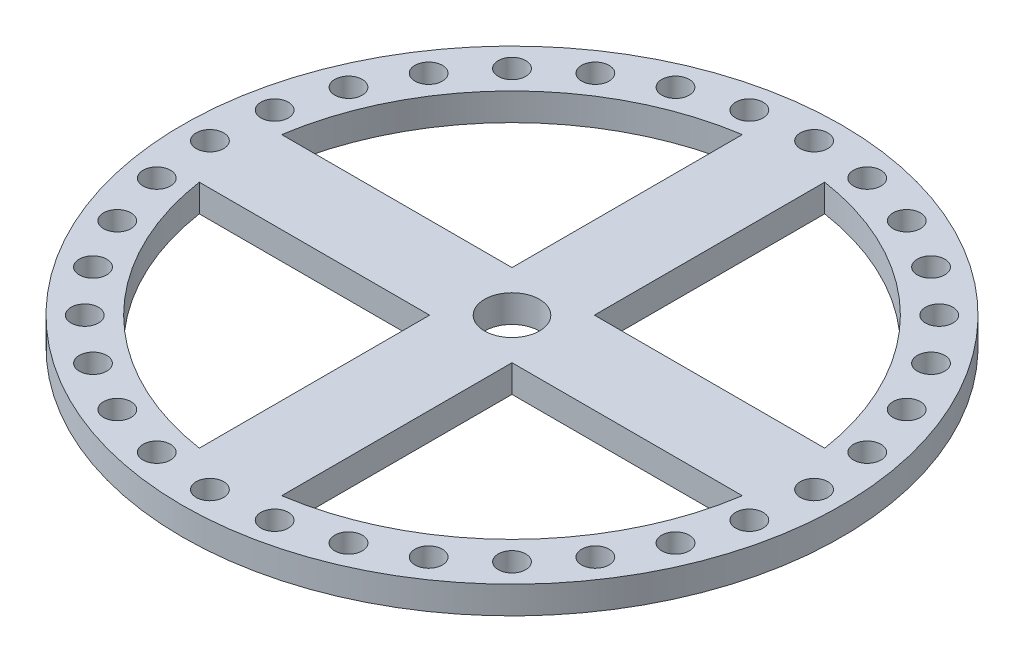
ISO-10303-21;
HEADER;
FILE_DESCRIPTION(('STEP AP214'),'2;1');
FILE_NAME('part.step','',(''),(''),'','','');
FILE_SCHEMA(('AUTOMOTIVE_DESIGN { 1 0 10303 214 1 1 1 1 }'));
ENDSEC;
DATA;
#1=APPLICATION_CONTEXT('core data for automotive mechanical design processes');
#2=APPLICATION_PROTOCOL_DEFINITION('international standard','automotive_design',2000,#1);
#3=PRODUCT_CONTEXT('',#1,'mechanical');
#4=PRODUCT('Part','Part','',(#3));
#5=PRODUCT_RELATED_PRODUCT_CATEGORY('part','',(#4));
#6=PRODUCT_DEFINITION_FORMATION('','',#4);
#7=PRODUCT_DEFINITION_CONTEXT('part definition',#1,'design');
#8=PRODUCT_DEFINITION('design','',#6,#7);
#9=PRODUCT_DEFINITION_SHAPE('','',#8);
#10=(LENGTH_UNIT() NAMED_UNIT(*) SI_UNIT(.MILLI.,.METRE.));
#11=(NAMED_UNIT(*) PLANE_ANGLE_UNIT() SI_UNIT($,.RADIAN.));
#12=(NAMED_UNIT(*) SI_UNIT($,.STERADIAN.) SOLID_ANGLE_UNIT());
#13=UNCERTAINTY_MEASURE_WITH_UNIT(LENGTH_MEASURE(1.E-05),#10,'distance_accuracy_value','');
#14=(GEOMETRIC_REPRESENTATION_CONTEXT(3) GLOBAL_UNCERTAINTY_ASSIGNED_CONTEXT((#13)) GLOBAL_UNIT_ASSIGNED_CONTEXT((#10,
#11,#12)) REPRESENTATION_CONTEXT('',''));
#15=CARTESIAN_POINT('',(0.,0.,0.));
#16=DIRECTION('',(0.,0.,1.));
#17=DIRECTION('',(1.,0.,0.));
#18=AXIS2_PLACEMENT_3D('',#15,#16,#17);
#19=CARTESIAN_POINT('',(0.,5.,7.50000000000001));
#20=DIRECTION('',(0.,0.,-1.));
#21=DIRECTION('',(-1.,0.,0.));
#22=AXIS2_PLACEMENT_3D('',#19,#20,#21);
#23=PLANE('',#22);
#24=DIRECTION('',(1.,0.,0.));
#25=VECTOR('',#24,1.);
#26=CARTESIAN_POINT('',(0.,0.,7.50000000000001));
#27=LINE('',#26,#25);
#28=CARTESIAN_POINT('',(7.5,0.,7.50000000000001));
#29=VERTEX_POINT('',#28);
#30=CARTESIAN_POINT('',(49.434299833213,0.,7.50000000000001));
#31=VERTEX_POINT('',#30);
#32=EDGE_CURVE('E137',#29,#31,#27,.T.);
#33=ORIENTED_EDGE('',*,*,#32,.T.);
#34=DIRECTION('',(0.,-1.,0.));
#35=VECTOR('',#34,1.);
#36=CARTESIAN_POINT('',(49.434299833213,5.,7.50000000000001));
#37=LINE('',#36,#35);
#38=CARTESIAN_POINT('',(49.434299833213,5.,7.50000000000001));
#39=VERTEX_POINT('',#38);
#40=EDGE_CURVE('E11',#39,#31,#37,.T.);
#41=ORIENTED_EDGE('',*,*,#40,.F.);
#42=DIRECTION('',(1.,0.,0.));
#43=VECTOR('',#42,1.);
#44=CARTESIAN_POINT('',(0.,5.,7.50000000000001));
#45=LINE('',#44,#43);
#46=CARTESIAN_POINT('',(7.5,5.,7.50000000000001));
#47=VERTEX_POINT('',#46);
#48=EDGE_CURVE('E126',#47,#39,#45,.T.);
#49=ORIENTED_EDGE('',*,*,#48,.F.);
#50=DIRECTION('',(0.,-1.,0.));
#51=VECTOR('',#50,1.);
#52=CARTESIAN_POINT('',(7.5,5.,7.50000000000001));
#53=LINE('',#52,#51);
#54=EDGE_CURVE('E403',#47,#29,#53,.T.);
#55=ORIENTED_EDGE('',*,*,#54,.T.);
#56=EDGE_LOOP('',(#33,#41,#49,#55));
#57=FACE_BOUND('',#56,.T.);
#58=ADVANCED_FACE('F33',(#57),#23,.F.);
#59=CARTESIAN_POINT('',(0.,5.,0.));
#60=DIRECTION('',(0.,-1.,0.));
#61=DIRECTION('',(0.,0.,-1.));
#62=AXIS2_PLACEMENT_3D('',#59,#60,#61);
#63=CYLINDRICAL_SURFACE('',#62,50.);
#64=CARTESIAN_POINT('',(0.,0.,0.));
#65=DIRECTION('',(0.,1.,0.));
#66=DIRECTION('',(0.,0.,1.));
#67=AXIS2_PLACEMENT_3D('',#64,#65,#66);
#68=CIRCLE('',#67,50.);
#69=CARTESIAN_POINT('',(7.5,0.,49.434299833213));
#70=VERTEX_POINT('',#69);
#71=EDGE_CURVE('E283',#70,#31,#68,.T.);
#72=ORIENTED_EDGE('',*,*,#71,.F.);
#73=DIRECTION('',(0.,-1.,0.));
#74=VECTOR('',#73,1.);
#75=CARTESIAN_POINT('',(7.5,5.,49.434299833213));
#76=LINE('',#75,#74);
#77=CARTESIAN_POINT('',(7.5,5.,49.434299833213));
#78=VERTEX_POINT('',#77);
#79=EDGE_CURVE('E43',#78,#70,#76,.T.);
#80=ORIENTED_EDGE('',*,*,#79,.F.);
#81=CARTESIAN_POINT('',(0.,5.,0.));
#82=DIRECTION('',(0.,1.,0.));
#83=DIRECTION('',(0.,0.,1.));
#84=AXIS2_PLACEMENT_3D('',#81,#82,#83);
#85=CIRCLE('',#84,50.);
#86=EDGE_CURVE('E131',#78,#39,#85,.T.);
#87=ORIENTED_EDGE('',*,*,#86,.T.);
#88=ORIENTED_EDGE('',*,*,#40,.T.);
#89=EDGE_LOOP('',(#72,#80,#87,#88));
#90=FACE_BOUND('',#89,.T.);
#91=ADVANCED_FACE('F141',(#90),#63,.F.);
#92=CARTESIAN_POINT('',(-49.434299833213,0.,7.50000000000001));
#93=VERTEX_POINT('',#92);
#94=CARTESIAN_POINT('',(-7.5,0.,49.434299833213));
#95=VERTEX_POINT('',#94);
#96=EDGE_CURVE('E296',#93,#95,#68,.T.);
#97=ORIENTED_EDGE('',*,*,#96,.F.);
#98=DIRECTION('',(0.,-1.,0.));
#99=VECTOR('',#98,1.);
#100=CARTESIAN_POINT('',(-49.434299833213,5.,7.50000000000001));
#101=LINE('',#100,#99);
#102=CARTESIAN_POINT('',(-49.434299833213,5.,7.50000000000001));
#103=VERTEX_POINT('',#102);
#104=EDGE_CURVE('E405',#103,#93,#101,.T.);
#105=ORIENTED_EDGE('',*,*,#104,.F.);
#106=CARTESIAN_POINT('',(-7.5,5.,49.434299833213));
#107=VERTEX_POINT('',#106);
#108=EDGE_CURVE('E143',#103,#107,#85,.T.);
#109=ORIENTED_EDGE('',*,*,#108,.T.);
#110=DIRECTION('',(0.,-1.,0.));
#111=VECTOR('',#110,1.);
#112=CARTESIAN_POINT('',(-7.5,5.,49.434299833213));
#113=LINE('',#112,#111);
#114=EDGE_CURVE('E407',#107,#95,#113,.T.);
#115=ORIENTED_EDGE('',*,*,#114,.T.);
#116=EDGE_LOOP('',(#97,#105,#109,#115));
#117=FACE_BOUND('',#116,.T.);
#118=ADVANCED_FACE('F440',(#117),#63,.F.);
#119=CARTESIAN_POINT('',(0.,5.,7.50000000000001));
#120=DIRECTION('',(0.,0.,-1.));
#121=DIRECTION('',(-1.,0.,0.));
#122=AXIS2_PLACEMENT_3D('',#119,#120,#121);
#123=PLANE('',#122);
#124=DIRECTION('',(1.,0.,0.));
#125=VECTOR('',#124,1.);
#126=CARTESIAN_POINT('',(0.,0.,7.50000000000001));
#127=LINE('',#126,#125);
#128=CARTESIAN_POINT('',(-7.5,0.,7.50000000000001));
#129=VERTEX_POINT('',#128);
#130=EDGE_CURVE('E297',#93,#129,#127,.T.);
#131=ORIENTED_EDGE('',*,*,#130,.T.);
#132=DIRECTION('',(0.,-1.,0.));
#133=VECTOR('',#132,1.);
#134=CARTESIAN_POINT('',(-7.5,5.,7.50000000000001));
#135=LINE('',#134,#133);
#136=CARTESIAN_POINT('',(-7.5,5.,7.50000000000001));
#137=VERTEX_POINT('',#136);
#138=EDGE_CURVE('E409',#137,#129,#135,.T.);
#139=ORIENTED_EDGE('',*,*,#138,.F.);
#140=DIRECTION('',(1.,0.,0.));
#141=VECTOR('',#140,1.);
#142=CARTESIAN_POINT('',(0.,5.,7.50000000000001));
#143=LINE('',#142,#141);
#144=EDGE_CURVE('E149',#103,#137,#143,.T.);
#145=ORIENTED_EDGE('',*,*,#144,.F.);
#146=ORIENTED_EDGE('',*,*,#104,.T.);
#147=EDGE_LOOP('',(#131,#139,#145,#146));
#148=FACE_BOUND('',#147,.T.);
#149=ADVANCED_FACE('F444',(#148),#123,.F.);
#150=CARTESIAN_POINT('',(-7.5,0.,-49.434299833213));
#151=VERTEX_POINT('',#150);
#152=CARTESIAN_POINT('',(-49.434299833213,0.,-7.50000000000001));
#153=VERTEX_POINT('',#152);
#154=EDGE_CURVE('E284',#151,#153,#68,.T.);
#155=ORIENTED_EDGE('',*,*,#154,.F.);
#156=DIRECTION('',(0.,-1.,0.));
#157=VECTOR('',#156,1.);
#158=CARTESIAN_POINT('',(-7.5,5.,-49.434299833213));
#159=LINE('',#158,#157);
#160=CARTESIAN_POINT('',(-7.5,5.,-49.434299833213));
#161=VERTEX_POINT('',#160);
#162=EDGE_CURVE('E410',#161,#151,#159,.T.);
#163=ORIENTED_EDGE('',*,*,#162,.F.);
#164=CARTESIAN_POINT('',(-49.434299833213,5.,-7.50000000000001));
#165=VERTEX_POINT('',#164);
#166=EDGE_CURVE('E151',#161,#165,#85,.T.);
#167=ORIENTED_EDGE('',*,*,#166,.T.);
#168=DIRECTION('',(0.,-1.,0.));
#169=VECTOR('',#168,1.);
#170=CARTESIAN_POINT('',(-49.434299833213,5.,-7.50000000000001));
#171=LINE('',#170,#169);
#172=EDGE_CURVE('E413',#165,#153,#171,.T.);
#173=ORIENTED_EDGE('',*,*,#172,.T.);
#174=EDGE_LOOP('',(#155,#163,#167,#173));
#175=FACE_BOUND('',#174,.T.);
#176=ADVANCED_FACE('F544',(#175),#63,.F.);
#177=CARTESIAN_POINT('',(-7.5,5.,0.));
#178=DIRECTION('',(-1.,0.,0.));
#179=DIRECTION('',(0.,0.,1.));
#180=AXIS2_PLACEMENT_3D('',#177,#178,#179);
#181=PLANE('',#180);
#182=DIRECTION('',(0.,0.,-1.));
#183=VECTOR('',#182,1.);
#184=CARTESIAN_POINT('',(-7.5,0.,0.));
#185=LINE('',#184,#183);
#186=CARTESIAN_POINT('',(-7.5,0.,-7.50000000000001));
#187=VERTEX_POINT('',#186);
#188=EDGE_CURVE('E290',#187,#151,#185,.T.);
#189=ORIENTED_EDGE('',*,*,#188,.F.);
#190=DIRECTION('',(0.,-1.,0.));
#191=VECTOR('',#190,1.);
#192=CARTESIAN_POINT('',(-7.5,5.,-7.50000000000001));
#193=LINE('',#192,#191);
#194=CARTESIAN_POINT('',(-7.5,5.,-7.50000000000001));
#195=VERTEX_POINT('',#194);
#196=EDGE_CURVE('E415',#195,#187,#193,.T.);
#197=ORIENTED_EDGE('',*,*,#196,.F.);
#198=DIRECTION('',(0.,0.,-1.));
#199=VECTOR('',#198,1.);
#200=CARTESIAN_POINT('',(-7.5,5.,0.));
#201=LINE('',#200,#199);
#202=EDGE_CURVE('E160',#195,#161,#201,.T.);
#203=ORIENTED_EDGE('',*,*,#202,.T.);
#204=ORIENTED_EDGE('',*,*,#162,.T.);
#205=EDGE_LOOP('',(#189,#197,#203,#204));
#206=FACE_BOUND('',#205,.T.);
#207=ADVANCED_FACE('F548',(#206),#181,.T.);
#208=CARTESIAN_POINT('',(49.434299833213,0.,-7.50000000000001));
#209=VERTEX_POINT('',#208);
#210=CARTESIAN_POINT('',(7.5,0.,-49.434299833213));
#211=VERTEX_POINT('',#210);
#212=EDGE_CURVE('E279',#209,#211,#68,.T.);
#213=ORIENTED_EDGE('',*,*,#212,.F.);
#214=DIRECTION('',(0.,-1.,0.));
#215=VECTOR('',#214,1.);
#216=CARTESIAN_POINT('',(49.434299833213,5.,-7.50000000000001));
#217=LINE('',#216,#215);
#218=CARTESIAN_POINT('',(49.434299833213,5.,-7.50000000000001));
#219=VERTEX_POINT('',#218);
#220=EDGE_CURVE('E37',#219,#209,#217,.T.);
#221=ORIENTED_EDGE('',*,*,#220,.F.);
#222=CARTESIAN_POINT('',(7.5,5.,-49.434299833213));
#223=VERTEX_POINT('',#222);
#224=EDGE_CURVE('E144',#219,#223,#85,.T.);
#225=ORIENTED_EDGE('',*,*,#224,.T.);
#226=DIRECTION('',(0.,-1.,0.));
#227=VECTOR('',#226,1.);
#228=CARTESIAN_POINT('',(7.5,5.,-49.434299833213));
#229=LINE('',#228,#227);
#230=EDGE_CURVE('E278',#223,#211,#229,.T.);
#231=ORIENTED_EDGE('',*,*,#230,.T.);
#232=EDGE_LOOP('',(#213,#221,#225,#231));
#233=FACE_BOUND('',#232,.T.);
#234=ADVANCED_FACE('F423',(#233),#63,.F.);
#235=CARTESIAN_POINT('',(0.,5.,-7.50000000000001));
#236=DIRECTION('',(0.,0.,-1.));
#237=DIRECTION('',(-1.,0.,0.));
#238=AXIS2_PLACEMENT_3D('',#235,#236,#237);
#239=PLANE('',#238);
#240=DIRECTION('',(1.,0.,0.));
#241=VECTOR('',#240,1.);
#242=CARTESIAN_POINT('',(0.,0.,-7.50000000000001));
#243=LINE('',#242,#241);
#244=CARTESIAN_POINT('',(7.5,0.,-7.50000000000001));
#245=VERTEX_POINT('',#244);
#246=EDGE_CURVE('E282',#245,#209,#243,.T.);
#247=ORIENTED_EDGE('',*,*,#246,.F.);
#248=DIRECTION('',(0.,-1.,0.));
#249=VECTOR('',#248,1.);
#250=CARTESIAN_POINT('',(7.5,5.,-7.50000000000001));
#251=LINE('',#250,#249);
#252=CARTESIAN_POINT('',(7.5,5.,-7.50000000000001));
#253=VERTEX_POINT('',#252);
#254=EDGE_CURVE('E418',#253,#245,#251,.T.);
#255=ORIENTED_EDGE('',*,*,#254,.F.);
#256=DIRECTION('',(1.,0.,0.));
#257=VECTOR('',#256,1.);
#258=CARTESIAN_POINT('',(0.,5.,-7.50000000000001));
#259=LINE('',#258,#257);
#260=EDGE_CURVE('E152',#253,#219,#259,.T.);
#261=ORIENTED_EDGE('',*,*,#260,.T.);
#262=ORIENTED_EDGE('',*,*,#220,.T.);
#263=EDGE_LOOP('',(#247,#255,#261,#262));
#264=FACE_BOUND('',#263,.T.);
#265=ADVANCED_FACE('F35',(#264),#239,.T.);
#266=CARTESIAN_POINT('',(0.,5.,-55.));
#267=DIRECTION('',(0.,-1.,0.));
#268=DIRECTION('',(0.,0.,-1.));
#269=AXIS2_PLACEMENT_3D('',#266,#267,#268);
#270=CYLINDRICAL_SURFACE('',#269,2.5);
#271=CARTESIAN_POINT('',(0.,5.,-55.));
#272=DIRECTION('',(0.,1.,0.));
#273=DIRECTION('',(0.,0.,1.));
#274=AXIS2_PLACEMENT_3D('',#271,#272,#273);
#275=CIRCLE('',#274,2.5);
#276=CARTESIAN_POINT('',(0.,5.,-52.5));
#277=VERTEX_POINT('',#276);
#278=EDGE_CURVE('E272',#277,#277,#275,.T.);
#279=ORIENTED_EDGE('',*,*,#278,.T.);
#280=EDGE_LOOP('',(#279));
#281=FACE_BOUND('',#280,.T.);
#282=CARTESIAN_POINT('',(0.,0.,-55.));
#283=DIRECTION('',(0.,1.,0.));
#284=DIRECTION('',(0.,0.,1.));
#285=AXIS2_PLACEMENT_3D('',#282,#283,#284);
#286=CIRCLE('',#285,2.5);
#287=CARTESIAN_POINT('',(0.,0.,-52.5));
#288=VERTEX_POINT('',#287);
#289=EDGE_CURVE('E157',#288,#288,#286,.T.);
#290=ORIENTED_EDGE('',*,*,#289,.F.);
#291=EDGE_LOOP('',(#290));
#292=FACE_BOUND('',#291,.T.);
#293=ADVANCED_FACE('F592',(#281,#292),#270,.F.);
#294=CARTESIAN_POINT('',(10.7299677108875,5.,-53.9431904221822));
#295=DIRECTION('',(0.,-1.,0.));
#296=DIRECTION('',(0.,0.,-1.));
#297=AXIS2_PLACEMENT_3D('',#294,#295,#296);
#298=CYLINDRICAL_SURFACE('',#297,2.49999999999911);
#299=CARTESIAN_POINT('',(10.7299677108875,5.,-53.9431904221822));
#300=DIRECTION('',(0.,1.,0.));
#301=DIRECTION('',(0.,0.,1.));
#302=AXIS2_PLACEMENT_3D('',#299,#300,#301);
#303=CIRCLE('',#302,2.49999999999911);
#304=CARTESIAN_POINT('',(10.7299677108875,5.,-51.4431904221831));
#305=VERTEX_POINT('',#304);
#306=EDGE_CURVE('E269',#305,#305,#303,.T.);
#307=ORIENTED_EDGE('',*,*,#306,.T.);
#308=EDGE_LOOP('',(#307));
#309=FACE_BOUND('',#308,.T.);
#310=CARTESIAN_POINT('',(10.7299677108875,0.,-53.9431904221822));
#311=DIRECTION('',(0.,1.,0.));
#312=DIRECTION('',(0.,0.,1.));
#313=AXIS2_PLACEMENT_3D('',#310,#311,#312);
#314=CIRCLE('',#313,2.49999999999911);
#315=CARTESIAN_POINT('',(10.7299677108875,0.,-51.4431904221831));
#316=VERTEX_POINT('',#315);
#317=EDGE_CURVE('E398',#316,#316,#314,.T.);
#318=ORIENTED_EDGE('',*,*,#317,.F.);
#319=EDGE_LOOP('',(#318));
#320=FACE_BOUND('',#319,.T.);
#321=ADVANCED_FACE('F600',(#309,#320),#298,.F.);
#322=CARTESIAN_POINT('',(21.0475887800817,5.,-50.8133742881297));
#323=DIRECTION('',(0.,-1.,0.));
#324=DIRECTION('',(0.,0.,-1.));
#325=AXIS2_PLACEMENT_3D('',#322,#323,#324);
#326=CYLINDRICAL_SURFACE('',#325,2.49999999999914);
#327=CARTESIAN_POINT('',(21.0475887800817,5.,-50.8133742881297));
#328=DIRECTION('',(0.,1.,0.));
#329=DIRECTION('',(0.,0.,1.));
#330=AXIS2_PLACEMENT_3D('',#327,#328,#329);
#331=CIRCLE('',#330,2.49999999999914);
#332=CARTESIAN_POINT('',(21.0475887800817,5.,-48.3133742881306));
#333=VERTEX_POINT('',#332);
#334=EDGE_CURVE('E266',#333,#333,#331,.T.);
#335=ORIENTED_EDGE('',*,*,#334,.T.);
#336=EDGE_LOOP('',(#335));
#337=FACE_BOUND('',#336,.T.);
#338=CARTESIAN_POINT('',(21.0475887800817,0.,-50.8133742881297));
#339=DIRECTION('',(0.,1.,0.));
#340=DIRECTION('',(0.,0.,1.));
#341=AXIS2_PLACEMENT_3D('',#338,#339,#340);
#342=CIRCLE('',#341,2.49999999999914);
#343=CARTESIAN_POINT('',(21.0475887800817,0.,-48.3133742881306));
#344=VERTEX_POINT('',#343);
#345=EDGE_CURVE('E395',#344,#344,#342,.T.);
#346=ORIENTED_EDGE('',*,*,#345,.F.);
#347=EDGE_LOOP('',(#346));
#348=FACE_BOUND('',#347,.T.);
#349=ADVANCED_FACE('F609',(#337,#348),#326,.F.);
#350=CARTESIAN_POINT('',(30.5563628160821,5.,-45.730828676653));
#351=DIRECTION('',(0.,-1.,0.));
#352=DIRECTION('',(0.,0.,-1.));
#353=AXIS2_PLACEMENT_3D('',#350,#351,#352);
#354=CYLINDRICAL_SURFACE('',#353,2.50000000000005);
#355=CARTESIAN_POINT('',(30.5563628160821,5.,-45.730828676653));
#356=DIRECTION('',(0.,1.,0.));
#357=DIRECTION('',(0.,0.,1.));
#358=AXIS2_PLACEMENT_3D('',#355,#356,#357);
#359=CIRCLE('',#358,2.50000000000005);
#360=CARTESIAN_POINT('',(30.5563628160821,5.,-43.230828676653));
#361=VERTEX_POINT('',#360);
#362=EDGE_CURVE('E263',#361,#361,#359,.T.);
#363=ORIENTED_EDGE('',*,*,#362,.T.);
#364=EDGE_LOOP('',(#363));
#365=FACE_BOUND('',#364,.T.);
#366=CARTESIAN_POINT('',(30.5563628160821,0.,-45.730828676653));
#367=DIRECTION('',(0.,1.,0.));
#368=DIRECTION('',(0.,0.,1.));
#369=AXIS2_PLACEMENT_3D('',#366,#367,#368);
#370=CIRCLE('',#369,2.50000000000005);
#371=CARTESIAN_POINT('',(30.5563628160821,0.,-43.230828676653));
#372=VERTEX_POINT('',#371);
#373=EDGE_CURVE('E392',#372,#372,#370,.T.);
#374=ORIENTED_EDGE('',*,*,#373,.F.);
#375=EDGE_LOOP('',(#374));
#376=FACE_BOUND('',#375,.T.);
#377=ADVANCED_FACE('F619',(#365,#376),#354,.F.);
#378=CARTESIAN_POINT('',(38.890872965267,5.,-38.8908729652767));
#379=DIRECTION('',(0.,-1.,0.));
#380=DIRECTION('',(0.,0.,-1.));
#381=AXIS2_PLACEMENT_3D('',#378,#379,#380);
#382=CYLINDRICAL_SURFACE('',#381,2.50000000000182);
#383=CARTESIAN_POINT('',(38.890872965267,5.,-38.8908729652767));
#384=DIRECTION('',(0.,1.,0.));
#385=DIRECTION('',(0.,0.,1.));
#386=AXIS2_PLACEMENT_3D('',#383,#384,#385);
#387=CIRCLE('',#386,2.50000000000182);
#388=CARTESIAN_POINT('',(38.890872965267,5.,-36.3908729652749));
#389=VERTEX_POINT('',#388);
#390=EDGE_CURVE('E260',#389,#389,#387,.T.);
#391=ORIENTED_EDGE('',*,*,#390,.T.);
#392=EDGE_LOOP('',(#391));
#393=FACE_BOUND('',#392,.T.);
#394=CARTESIAN_POINT('',(38.890872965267,0.,-38.8908729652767));
#395=DIRECTION('',(0.,1.,0.));
#396=DIRECTION('',(0.,0.,1.));
#397=AXIS2_PLACEMENT_3D('',#394,#395,#396);
#398=CIRCLE('',#397,2.50000000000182);
#399=CARTESIAN_POINT('',(38.890872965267,0.,-36.3908729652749));
#400=VERTEX_POINT('',#399);
#401=EDGE_CURVE('E389',#400,#400,#398,.T.);
#402=ORIENTED_EDGE('',*,*,#401,.F.);
#403=EDGE_LOOP('',(#402));
#404=FACE_BOUND('',#403,.T.);
#405=ADVANCED_FACE('F629',(#393,#404),#382,.F.);
#406=CARTESIAN_POINT('',(45.7308286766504,5.,-30.5563628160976));
#407=DIRECTION('',(0.,-1.,0.));
#408=DIRECTION('',(0.,0.,-1.));
#409=AXIS2_PLACEMENT_3D('',#406,#407,#408);
#410=CYLINDRICAL_SURFACE('',#409,2.50000000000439);
#411=CARTESIAN_POINT('',(45.7308286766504,5.,-30.5563628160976));
#412=DIRECTION('',(0.,1.,0.));
#413=DIRECTION('',(0.,0.,1.));
#414=AXIS2_PLACEMENT_3D('',#411,#412,#413);
#415=CIRCLE('',#414,2.50000000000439);
#416=CARTESIAN_POINT('',(45.7308286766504,5.,-28.0563628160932));
#417=VERTEX_POINT('',#416);
#418=EDGE_CURVE('E257',#417,#417,#415,.T.);
#419=ORIENTED_EDGE('',*,*,#418,.T.);
#420=EDGE_LOOP('',(#419));
#421=FACE_BOUND('',#420,.T.);
#422=CARTESIAN_POINT('',(45.7308286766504,0.,-30.5563628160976));
#423=DIRECTION('',(0.,1.,0.));
#424=DIRECTION('',(0.,0.,1.));
#425=AXIS2_PLACEMENT_3D('',#422,#423,#424);
#426=CIRCLE('',#425,2.50000000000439);
#427=CARTESIAN_POINT('',(45.7308286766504,0.,-28.0563628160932));
#428=VERTEX_POINT('',#427);
#429=EDGE_CURVE('E386',#428,#428,#426,.T.);
#430=ORIENTED_EDGE('',*,*,#429,.F.);
#431=EDGE_LOOP('',(#430));
#432=FACE_BOUND('',#431,.T.);
#433=ADVANCED_FACE('F639',(#421,#432),#410,.F.);
#434=CARTESIAN_POINT('',(50.8133742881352,5.,-21.0475887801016));
#435=DIRECTION('',(0.,-1.,0.));
#436=DIRECTION('',(0.,0.,-1.));
#437=AXIS2_PLACEMENT_3D('',#434,#435,#436);
#438=CYLINDRICAL_SURFACE('',#437,2.50000000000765);
#439=CARTESIAN_POINT('',(50.8133742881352,5.,-21.0475887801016));
#440=DIRECTION('',(0.,1.,0.));
#441=DIRECTION('',(0.,0.,1.));
#442=AXIS2_PLACEMENT_3D('',#439,#440,#441);
#443=CIRCLE('',#442,2.50000000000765);
#444=CARTESIAN_POINT('',(50.8133742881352,5.,-18.5475887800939));
#445=VERTEX_POINT('',#444);
#446=EDGE_CURVE('E254',#445,#445,#443,.T.);
#447=ORIENTED_EDGE('',*,*,#446,.T.);
#448=EDGE_LOOP('',(#447));
#449=FACE_BOUND('',#448,.T.);
#450=CARTESIAN_POINT('',(50.8133742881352,0.,-21.0475887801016));
#451=DIRECTION('',(0.,1.,0.));
#452=DIRECTION('',(0.,0.,1.));
#453=AXIS2_PLACEMENT_3D('',#450,#451,#452);
#454=CIRCLE('',#453,2.50000000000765);
#455=CARTESIAN_POINT('',(50.8133742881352,0.,-18.5475887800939));
#456=VERTEX_POINT('',#455);
#457=EDGE_CURVE('E383',#456,#456,#454,.T.);
#458=ORIENTED_EDGE('',*,*,#457,.F.);
#459=EDGE_LOOP('',(#458));
#460=FACE_BOUND('',#459,.T.);
#461=ADVANCED_FACE('F649',(#449,#460),#438,.F.);
#462=CARTESIAN_POINT('',(53.9431904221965,5.,-10.72996771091));
#463=DIRECTION('',(0.,-1.,0.));
#464=DIRECTION('',(0.,0.,-1.));
#465=AXIS2_PLACEMENT_3D('',#462,#463,#464);
#466=CYLINDRICAL_SURFACE('',#465,2.50000000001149);
#467=CARTESIAN_POINT('',(53.9431904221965,5.,-10.72996771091));
#468=DIRECTION('',(0.,1.,0.));
#469=DIRECTION('',(0.,0.,1.));
#470=AXIS2_PLACEMENT_3D('',#467,#468,#469);
#471=CIRCLE('',#470,2.50000000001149);
#472=CARTESIAN_POINT('',(53.9431904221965,5.,-8.22996771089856));
#473=VERTEX_POINT('',#472);
#474=EDGE_CURVE('E251',#473,#473,#471,.T.);
#475=ORIENTED_EDGE('',*,*,#474,.T.);
#476=EDGE_LOOP('',(#475));
#477=FACE_BOUND('',#476,.T.);
#478=CARTESIAN_POINT('',(53.9431904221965,0.,-10.72996771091));
#479=DIRECTION('',(0.,1.,0.));
#480=DIRECTION('',(0.,0.,1.));
#481=AXIS2_PLACEMENT_3D('',#478,#479,#480);
#482=CIRCLE('',#481,2.50000000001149);
#483=CARTESIAN_POINT('',(53.9431904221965,0.,-8.22996771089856));
#484=VERTEX_POINT('',#483);
#485=EDGE_CURVE('E380',#484,#484,#482,.T.);
#486=ORIENTED_EDGE('',*,*,#485,.F.);
#487=EDGE_LOOP('',(#486));
#488=FACE_BOUND('',#487,.T.);
#489=ADVANCED_FACE('F659',(#477,#488),#466,.F.);
#490=CARTESIAN_POINT('',(55.0000000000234,5.,-2.3441174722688E-11));
#491=DIRECTION('',(0.,-1.,0.));
#492=DIRECTION('',(0.,0.,-1.));
#493=AXIS2_PLACEMENT_3D('',#490,#491,#492);
#494=CYLINDRICAL_SURFACE('',#493,2.50000000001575);
#495=CARTESIAN_POINT('',(55.0000000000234,5.,-2.3441174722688E-11));
#496=DIRECTION('',(0.,1.,0.));
#497=DIRECTION('',(0.,0.,1.));
#498=AXIS2_PLACEMENT_3D('',#495,#496,#497);
#499=CIRCLE('',#498,2.50000000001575);
#500=CARTESIAN_POINT('',(55.0000000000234,5.,2.49999999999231));
#501=VERTEX_POINT('',#500);
#502=EDGE_CURVE('E248',#501,#501,#499,.T.);
#503=ORIENTED_EDGE('',*,*,#502,.T.);
#504=EDGE_LOOP('',(#503));
#505=FACE_BOUND('',#504,.T.);
#506=CARTESIAN_POINT('',(55.0000000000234,0.,-2.3441174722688E-11));
#507=DIRECTION('',(0.,1.,0.));
#508=DIRECTION('',(0.,0.,1.));
#509=AXIS2_PLACEMENT_3D('',#506,#507,#508);
#510=CIRCLE('',#509,2.50000000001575);
#511=CARTESIAN_POINT('',(55.0000000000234,0.,2.49999999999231));
#512=VERTEX_POINT('',#511);
#513=EDGE_CURVE('E377',#512,#512,#510,.T.);
#514=ORIENTED_EDGE('',*,*,#513,.F.);
#515=EDGE_LOOP('',(#514));
#516=FACE_BOUND('',#515,.T.);
#517=ADVANCED_FACE('F669',(#505,#516),#494,.F.);
#518=CARTESIAN_POINT('',(53.9431904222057,5.,10.7299677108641));
#519=DIRECTION('',(0.,-1.,0.));
#520=DIRECTION('',(0.,0.,-1.));
#521=AXIS2_PLACEMENT_3D('',#518,#519,#520);
#522=CYLINDRICAL_SURFACE('',#521,2.50000000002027);
#523=CARTESIAN_POINT('',(53.9431904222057,5.,10.7299677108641));
#524=DIRECTION('',(0.,1.,0.));
#525=DIRECTION('',(0.,0.,1.));
#526=AXIS2_PLACEMENT_3D('',#523,#524,#525);
#527=CIRCLE('',#526,2.50000000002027);
#528=CARTESIAN_POINT('',(53.9431904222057,5.,13.2299677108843));
#529=VERTEX_POINT('',#528);
#530=EDGE_CURVE('E245',#529,#529,#527,.T.);
#531=ORIENTED_EDGE('',*,*,#530,.T.);
#532=EDGE_LOOP('',(#531));
#533=FACE_BOUND('',#532,.T.);
#534=CARTESIAN_POINT('',(53.9431904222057,0.,10.7299677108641));
#535=DIRECTION('',(0.,1.,0.));
#536=DIRECTION('',(0.,0.,1.));
#537=AXIS2_PLACEMENT_3D('',#534,#535,#536);
#538=CIRCLE('',#537,2.50000000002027);
#539=CARTESIAN_POINT('',(53.9431904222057,0.,13.2299677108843));
#540=VERTEX_POINT('',#539);
#541=EDGE_CURVE('E374',#540,#540,#538,.T.);
#542=ORIENTED_EDGE('',*,*,#541,.F.);
#543=EDGE_LOOP('',(#542));
#544=FACE_BOUND('',#543,.T.);
#545=ADVANCED_FACE('F679',(#533,#544),#522,.F.);
#546=CARTESIAN_POINT('',(50.8133742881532,5.,21.0475887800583));
#547=DIRECTION('',(0.,-1.,0.));
#548=DIRECTION('',(0.,0.,-1.));
#549=AXIS2_PLACEMENT_3D('',#546,#547,#548);
#550=CYLINDRICAL_SURFACE('',#549,2.50000000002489);
#551=CARTESIAN_POINT('',(50.8133742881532,5.,21.0475887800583));
#552=DIRECTION('',(0.,1.,0.));
#553=DIRECTION('',(0.,0.,1.));
#554=AXIS2_PLACEMENT_3D('',#551,#552,#553);
#555=CIRCLE('',#554,2.50000000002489);
#556=CARTESIAN_POINT('',(50.8133742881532,5.,23.5475887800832));
#557=VERTEX_POINT('',#556);
#558=EDGE_CURVE('E242',#557,#557,#555,.T.);
#559=ORIENTED_EDGE('',*,*,#558,.T.);
#560=EDGE_LOOP('',(#559));
#561=FACE_BOUND('',#560,.T.);
#562=CARTESIAN_POINT('',(50.8133742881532,0.,21.0475887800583));
#563=DIRECTION('',(0.,1.,0.));
#564=DIRECTION('',(0.,0.,1.));
#565=AXIS2_PLACEMENT_3D('',#562,#563,#564);
#566=CIRCLE('',#565,2.50000000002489);
#567=CARTESIAN_POINT('',(50.8133742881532,0.,23.5475887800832));
#568=VERTEX_POINT('',#567);
#569=EDGE_CURVE('E371',#568,#568,#566,.T.);
#570=ORIENTED_EDGE('',*,*,#569,.F.);
#571=EDGE_LOOP('',(#570));
#572=FACE_BOUND('',#571,.T.);
#573=ADVANCED_FACE('F689',(#561,#572),#550,.F.);
#574=CARTESIAN_POINT('',(45.7308286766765,5.,30.5563628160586));
#575=DIRECTION('',(0.,-1.,0.));
#576=DIRECTION('',(0.,0.,-1.));
#577=AXIS2_PLACEMENT_3D('',#574,#575,#576);
#578=CYLINDRICAL_SURFACE('',#577,2.50000000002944);
#579=CARTESIAN_POINT('',(45.7308286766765,5.,30.5563628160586));
#580=DIRECTION('',(0.,1.,0.));
#581=DIRECTION('',(0.,0.,1.));
#582=AXIS2_PLACEMENT_3D('',#579,#580,#581);
#583=CIRCLE('',#582,2.50000000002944);
#584=CARTESIAN_POINT('',(45.7308286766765,5.,33.0563628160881));
#585=VERTEX_POINT('',#584);
#586=EDGE_CURVE('E239',#585,#585,#583,.T.);
#587=ORIENTED_EDGE('',*,*,#586,.T.);
#588=EDGE_LOOP('',(#587));
#589=FACE_BOUND('',#588,.T.);
#590=CARTESIAN_POINT('',(45.7308286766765,0.,30.5563628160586));
#591=DIRECTION('',(0.,1.,0.));
#592=DIRECTION('',(0.,0.,1.));
#593=AXIS2_PLACEMENT_3D('',#590,#591,#592);
#594=CIRCLE('',#593,2.50000000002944);
#595=CARTESIAN_POINT('',(45.7308286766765,0.,33.0563628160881));
#596=VERTEX_POINT('',#595);
#597=EDGE_CURVE('E368',#596,#596,#594,.T.);
#598=ORIENTED_EDGE('',*,*,#597,.F.);
#599=EDGE_LOOP('',(#598));
#600=FACE_BOUND('',#599,.T.);
#601=ADVANCED_FACE('F699',(#589,#600),#578,.F.);
#602=CARTESIAN_POINT('',(38.8908729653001,5.,38.8908729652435));
#603=DIRECTION('',(0.,-1.,0.));
#604=DIRECTION('',(0.,0.,-1.));
#605=AXIS2_PLACEMENT_3D('',#602,#603,#604);
#606=CYLINDRICAL_SURFACE('',#605,2.50000000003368);
#607=CARTESIAN_POINT('',(38.8908729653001,5.,38.8908729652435));
#608=DIRECTION('',(0.,1.,0.));
#609=DIRECTION('',(0.,0.,1.));
#610=AXIS2_PLACEMENT_3D('',#607,#608,#609);
#611=CIRCLE('',#610,2.50000000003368);
#612=CARTESIAN_POINT('',(38.8908729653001,5.,41.3908729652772));
#613=VERTEX_POINT('',#612);
#614=EDGE_CURVE('E236',#613,#613,#611,.T.);
#615=ORIENTED_EDGE('',*,*,#614,.T.);
#616=EDGE_LOOP('',(#615));
#617=FACE_BOUND('',#616,.T.);
#618=CARTESIAN_POINT('',(38.8908729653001,0.,38.8908729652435));
#619=DIRECTION('',(0.,1.,0.));
#620=DIRECTION('',(0.,0.,1.));
#621=AXIS2_PLACEMENT_3D('',#618,#619,#620);
#622=CIRCLE('',#621,2.50000000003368);
#623=CARTESIAN_POINT('',(38.8908729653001,0.,41.3908729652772));
#624=VERTEX_POINT('',#623);
#625=EDGE_CURVE('E365',#624,#624,#622,.T.);
#626=ORIENTED_EDGE('',*,*,#625,.F.);
#627=EDGE_LOOP('',(#626));
#628=FACE_BOUND('',#627,.T.);
#629=ADVANCED_FACE('F709',(#617,#628),#606,.F.);
#630=CARTESIAN_POINT('',(30.556362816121,5.,45.730828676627));
#631=DIRECTION('',(0.,-1.,0.));
#632=DIRECTION('',(0.,0.,-1.));
#633=AXIS2_PLACEMENT_3D('',#630,#631,#632);
#634=CYLINDRICAL_SURFACE('',#633,2.50000000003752);
#635=CARTESIAN_POINT('',(30.556362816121,5.,45.730828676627));
#636=DIRECTION('',(0.,1.,0.));
#637=DIRECTION('',(0.,0.,1.));
#638=AXIS2_PLACEMENT_3D('',#635,#636,#637);
#639=CIRCLE('',#638,2.50000000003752);
#640=CARTESIAN_POINT('',(30.556362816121,5.,48.2308286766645));
#641=VERTEX_POINT('',#640);
#642=EDGE_CURVE('E233',#641,#641,#639,.T.);
#643=ORIENTED_EDGE('',*,*,#642,.T.);
#644=EDGE_LOOP('',(#643));
#645=FACE_BOUND('',#644,.T.);
#646=CARTESIAN_POINT('',(30.556362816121,0.,45.730828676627));
#647=DIRECTION('',(0.,1.,0.));
#648=DIRECTION('',(0.,0.,1.));
#649=AXIS2_PLACEMENT_3D('',#646,#647,#648);
#650=CIRCLE('',#649,2.50000000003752);
#651=CARTESIAN_POINT('',(30.556362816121,0.,48.2308286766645));
#652=VERTEX_POINT('',#651);
#653=EDGE_CURVE('E362',#652,#652,#650,.T.);
#654=ORIENTED_EDGE('',*,*,#653,.F.);
#655=EDGE_LOOP('',(#654));
#656=FACE_BOUND('',#655,.T.);
#657=ADVANCED_FACE('F719',(#645,#656),#634,.F.);
#658=CARTESIAN_POINT('',(21.047588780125,5.,50.8133742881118));
#659=DIRECTION('',(0.,-1.,0.));
#660=DIRECTION('',(0.,0.,-1.));
#661=AXIS2_PLACEMENT_3D('',#658,#659,#660);
#662=CYLINDRICAL_SURFACE('',#661,2.50000000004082);
#663=CARTESIAN_POINT('',(21.047588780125,5.,50.8133742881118));
#664=DIRECTION('',(0.,1.,0.));
#665=DIRECTION('',(0.,0.,1.));
#666=AXIS2_PLACEMENT_3D('',#663,#664,#665);
#667=CIRCLE('',#666,2.50000000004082);
#668=CARTESIAN_POINT('',(21.047588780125,5.,53.3133742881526));
#669=VERTEX_POINT('',#668);
#670=EDGE_CURVE('E230',#669,#669,#667,.T.);
#671=ORIENTED_EDGE('',*,*,#670,.T.);
#672=EDGE_LOOP('',(#671));
#673=FACE_BOUND('',#672,.T.);
#674=CARTESIAN_POINT('',(21.047588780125,0.,50.8133742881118));
#675=DIRECTION('',(0.,1.,0.));
#676=DIRECTION('',(0.,0.,1.));
#677=AXIS2_PLACEMENT_3D('',#674,#675,#676);
#678=CIRCLE('',#677,2.50000000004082);
#679=CARTESIAN_POINT('',(21.047588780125,0.,53.3133742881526));
#680=VERTEX_POINT('',#679);
#681=EDGE_CURVE('E359',#680,#680,#678,.T.);
#682=ORIENTED_EDGE('',*,*,#681,.F.);
#683=EDGE_LOOP('',(#682));
#684=FACE_BOUND('',#683,.T.);
#685=ADVANCED_FACE('F729',(#673,#684),#662,.F.);
#686=CARTESIAN_POINT('',(10.7299677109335,5.,53.9431904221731));
#687=DIRECTION('',(0.,-1.,0.));
#688=DIRECTION('',(0.,0.,-1.));
#689=AXIS2_PLACEMENT_3D('',#686,#687,#688);
#690=CYLINDRICAL_SURFACE('',#689,2.50000000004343);
#691=CARTESIAN_POINT('',(10.7299677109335,5.,53.9431904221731));
#692=DIRECTION('',(0.,1.,0.));
#693=DIRECTION('',(0.,0.,1.));
#694=AXIS2_PLACEMENT_3D('',#691,#692,#693);
#695=CIRCLE('',#694,2.50000000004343);
#696=CARTESIAN_POINT('',(10.7299677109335,5.,56.4431904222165));
#697=VERTEX_POINT('',#696);
#698=EDGE_CURVE('E227',#697,#697,#695,.T.);
#699=ORIENTED_EDGE('',*,*,#698,.T.);
#700=EDGE_LOOP('',(#699));
#701=FACE_BOUND('',#700,.T.);
#702=CARTESIAN_POINT('',(10.7299677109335,0.,53.9431904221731));
#703=DIRECTION('',(0.,1.,0.));
#704=DIRECTION('',(0.,0.,1.));
#705=AXIS2_PLACEMENT_3D('',#702,#703,#704);
#706=CIRCLE('',#705,2.50000000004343);
#707=CARTESIAN_POINT('',(10.7299677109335,0.,56.4431904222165));
#708=VERTEX_POINT('',#707);
#709=EDGE_CURVE('E356',#708,#708,#706,.T.);
#710=ORIENTED_EDGE('',*,*,#709,.F.);
#711=EDGE_LOOP('',(#710));
#712=FACE_BOUND('',#711,.T.);
#713=ADVANCED_FACE('F739',(#701,#712),#690,.F.);
#714=CARTESIAN_POINT('',(4.6882349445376E-11,5.,55.));
#715=DIRECTION('',(0.,-1.,0.));
#716=DIRECTION('',(0.,0.,-1.));
#717=AXIS2_PLACEMENT_3D('',#714,#715,#716);
#718=CYLINDRICAL_SURFACE('',#717,2.5000000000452);
#719=CARTESIAN_POINT('',(4.6882349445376E-11,5.,55.));
#720=DIRECTION('',(0.,1.,0.));
#721=DIRECTION('',(0.,0.,1.));
#722=AXIS2_PLACEMENT_3D('',#719,#720,#721);
#723=CIRCLE('',#722,2.5000000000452);
#724=CARTESIAN_POINT('',(4.6882349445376E-11,5.,57.5000000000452));
#725=VERTEX_POINT('',#724);
#726=EDGE_CURVE('E224',#725,#725,#723,.T.);
#727=ORIENTED_EDGE('',*,*,#726,.T.);
#728=EDGE_LOOP('',(#727));
#729=FACE_BOUND('',#728,.T.);
#730=CARTESIAN_POINT('',(4.6882349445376E-11,0.,55.));
#731=DIRECTION('',(0.,1.,0.));
#732=DIRECTION('',(0.,0.,1.));
#733=AXIS2_PLACEMENT_3D('',#730,#731,#732);
#734=CIRCLE('',#733,2.5000000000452);
#735=CARTESIAN_POINT('',(4.6882349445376E-11,0.,57.5000000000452));
#736=VERTEX_POINT('',#735);
#737=EDGE_CURVE('E353',#736,#736,#734,.T.);
#738=ORIENTED_EDGE('',*,*,#737,.F.);
#739=EDGE_LOOP('',(#738));
#740=FACE_BOUND('',#739,.T.);
#741=ADVANCED_FACE('F749',(#729,#740),#718,.F.);
#742=CARTESIAN_POINT('',(-10.7299677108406,5.,53.9431904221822));
#743=DIRECTION('',(0.,-1.,0.));
#744=DIRECTION('',(0.,0.,-1.));
#745=AXIS2_PLACEMENT_3D('',#742,#743,#744);
#746=CYLINDRICAL_SURFACE('',#745,2.50000000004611);
#747=CARTESIAN_POINT('',(-10.7299677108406,5.,53.9431904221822));
#748=DIRECTION('',(0.,1.,0.));
#749=DIRECTION('',(0.,0.,1.));
#750=AXIS2_PLACEMENT_3D('',#747,#748,#749);
#751=CIRCLE('',#750,2.50000000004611);
#752=CARTESIAN_POINT('',(-10.7299677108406,5.,56.4431904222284));
#753=VERTEX_POINT('',#752);
#754=EDGE_CURVE('E221',#753,#753,#751,.T.);
#755=ORIENTED_EDGE('',*,*,#754,.T.);
#756=EDGE_LOOP('',(#755));
#757=FACE_BOUND('',#756,.T.);
#758=CARTESIAN_POINT('',(-10.7299677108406,0.,53.9431904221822));
#759=DIRECTION('',(0.,1.,0.));
#760=DIRECTION('',(0.,0.,1.));
#761=AXIS2_PLACEMENT_3D('',#758,#759,#760);
#762=CIRCLE('',#761,2.50000000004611);
#763=CARTESIAN_POINT('',(-10.7299677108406,0.,56.4431904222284));
#764=VERTEX_POINT('',#763);
#765=EDGE_CURVE('E350',#764,#764,#762,.T.);
#766=ORIENTED_EDGE('',*,*,#765,.F.);
#767=EDGE_LOOP('',(#766));
#768=FACE_BOUND('',#767,.T.);
#769=ADVANCED_FACE('F759',(#757,#768),#746,.F.);
#770=CARTESIAN_POINT('',(-21.0475887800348,5.,50.8133742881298));
#771=DIRECTION('',(0.,-1.,0.));
#772=DIRECTION('',(0.,0.,-1.));
#773=AXIS2_PLACEMENT_3D('',#770,#771,#772);
#774=CYLINDRICAL_SURFACE('',#773,2.50000000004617);
#775=CARTESIAN_POINT('',(-21.0475887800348,5.,50.8133742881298));
#776=DIRECTION('',(0.,1.,0.));
#777=DIRECTION('',(0.,0.,1.));
#778=AXIS2_PLACEMENT_3D('',#775,#776,#777);
#779=CIRCLE('',#778,2.50000000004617);
#780=CARTESIAN_POINT('',(-21.0475887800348,5.,53.3133742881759));
#781=VERTEX_POINT('',#780);
#782=EDGE_CURVE('E218',#781,#781,#779,.T.);
#783=ORIENTED_EDGE('',*,*,#782,.T.);
#784=EDGE_LOOP('',(#783));
#785=FACE_BOUND('',#784,.T.);
#786=CARTESIAN_POINT('',(-21.0475887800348,0.,50.8133742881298));
#787=DIRECTION('',(0.,1.,0.));
#788=DIRECTION('',(0.,0.,1.));
#789=AXIS2_PLACEMENT_3D('',#786,#787,#788);
#790=CIRCLE('',#789,2.50000000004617);
#791=CARTESIAN_POINT('',(-21.0475887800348,0.,53.3133742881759));
#792=VERTEX_POINT('',#791);
#793=EDGE_CURVE('E347',#792,#792,#790,.T.);
#794=ORIENTED_EDGE('',*,*,#793,.F.);
#795=EDGE_LOOP('',(#794));
#796=FACE_BOUND('',#795,.T.);
#797=ADVANCED_FACE('F769',(#785,#796),#774,.F.);
#798=CARTESIAN_POINT('',(-30.5563628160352,5.,45.730828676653));
#799=DIRECTION('',(0.,-1.,0.));
#800=DIRECTION('',(0.,0.,-1.));
#801=AXIS2_PLACEMENT_3D('',#798,#799,#800);
#802=CYLINDRICAL_SURFACE('',#801,2.50000000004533);
#803=CARTESIAN_POINT('',(-30.5563628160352,5.,45.730828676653));
#804=DIRECTION('',(0.,1.,0.));
#805=DIRECTION('',(0.,0.,1.));
#806=AXIS2_PLACEMENT_3D('',#803,#804,#805);
#807=CIRCLE('',#806,2.50000000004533);
#808=CARTESIAN_POINT('',(-30.5563628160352,5.,48.2308286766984));
#809=VERTEX_POINT('',#808);
#810=EDGE_CURVE('E215',#809,#809,#807,.T.);
#811=ORIENTED_EDGE('',*,*,#810,.T.);
#812=EDGE_LOOP('',(#811));
#813=FACE_BOUND('',#812,.T.);
#814=CARTESIAN_POINT('',(-30.5563628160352,0.,45.730828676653));
#815=DIRECTION('',(0.,1.,0.));
#816=DIRECTION('',(0.,0.,1.));
#817=AXIS2_PLACEMENT_3D('',#814,#815,#816);
#818=CIRCLE('',#817,2.50000000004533);
#819=CARTESIAN_POINT('',(-30.5563628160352,0.,48.2308286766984));
#820=VERTEX_POINT('',#819);
#821=EDGE_CURVE('E344',#820,#820,#818,.T.);
#822=ORIENTED_EDGE('',*,*,#821,.F.);
#823=EDGE_LOOP('',(#822));
#824=FACE_BOUND('',#823,.T.);
#825=ADVANCED_FACE('F779',(#813,#824),#802,.F.);
#826=CARTESIAN_POINT('',(-38.8908729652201,5.,38.8908729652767));
#827=DIRECTION('',(0.,-1.,0.));
#828=DIRECTION('',(0.,0.,-1.));
#829=AXIS2_PLACEMENT_3D('',#826,#827,#828);
#830=CYLINDRICAL_SURFACE('',#829,2.50000000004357);
#831=CARTESIAN_POINT('',(-38.8908729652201,5.,38.8908729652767));
#832=DIRECTION('',(0.,1.,0.));
#833=DIRECTION('',(0.,0.,1.));
#834=AXIS2_PLACEMENT_3D('',#831,#832,#833);
#835=CIRCLE('',#834,2.50000000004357);
#836=CARTESIAN_POINT('',(-38.8908729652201,5.,41.3908729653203));
#837=VERTEX_POINT('',#836);
#838=EDGE_CURVE('E212',#837,#837,#835,.T.);
#839=ORIENTED_EDGE('',*,*,#838,.T.);
#840=EDGE_LOOP('',(#839));
#841=FACE_BOUND('',#840,.T.);
#842=CARTESIAN_POINT('',(-38.8908729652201,0.,38.8908729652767));
#843=DIRECTION('',(0.,1.,0.));
#844=DIRECTION('',(0.,0.,1.));
#845=AXIS2_PLACEMENT_3D('',#842,#843,#844);
#846=CIRCLE('',#845,2.50000000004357);
#847=CARTESIAN_POINT('',(-38.8908729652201,0.,41.3908729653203));
#848=VERTEX_POINT('',#847);
#849=EDGE_CURVE('E341',#848,#848,#846,.T.);
#850=ORIENTED_EDGE('',*,*,#849,.F.);
#851=EDGE_LOOP('',(#850));
#852=FACE_BOUND('',#851,.T.);
#853=ADVANCED_FACE('F789',(#841,#852),#830,.F.);
#854=CARTESIAN_POINT('',(-45.7308286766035,5.,30.5563628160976));
#855=DIRECTION('',(0.,-1.,0.));
#856=DIRECTION('',(0.,0.,-1.));
#857=AXIS2_PLACEMENT_3D('',#854,#855,#856);
#858=CYLINDRICAL_SURFACE('',#857,2.50000000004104);
#859=CARTESIAN_POINT('',(-45.7308286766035,5.,30.5563628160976));
#860=DIRECTION('',(0.,1.,0.));
#861=DIRECTION('',(0.,0.,1.));
#862=AXIS2_PLACEMENT_3D('',#859,#860,#861);
#863=CIRCLE('',#862,2.50000000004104);
#864=CARTESIAN_POINT('',(-45.7308286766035,5.,33.0563628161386));
#865=VERTEX_POINT('',#864);
#866=EDGE_CURVE('E209',#865,#865,#863,.T.);
#867=ORIENTED_EDGE('',*,*,#866,.T.);
#868=EDGE_LOOP('',(#867));
#869=FACE_BOUND('',#868,.T.);
#870=CARTESIAN_POINT('',(-45.7308286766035,0.,30.5563628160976));
#871=DIRECTION('',(0.,1.,0.));
#872=DIRECTION('',(0.,0.,1.));
#873=AXIS2_PLACEMENT_3D('',#870,#871,#872);
#874=CIRCLE('',#873,2.50000000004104);
#875=CARTESIAN_POINT('',(-45.7308286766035,0.,33.0563628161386));
#876=VERTEX_POINT('',#875);
#877=EDGE_CURVE('E338',#876,#876,#874,.T.);
#878=ORIENTED_EDGE('',*,*,#877,.F.);
#879=EDGE_LOOP('',(#878));
#880=FACE_BOUND('',#879,.T.);
#881=ADVANCED_FACE('F799',(#869,#880),#858,.F.);
#882=CARTESIAN_POINT('',(-50.8133742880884,5.,21.0475887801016));
#883=DIRECTION('',(0.,-1.,0.));
#884=DIRECTION('',(0.,0.,-1.));
#885=AXIS2_PLACEMENT_3D('',#882,#883,#884);
#886=CYLINDRICAL_SURFACE('',#885,2.5000000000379);
#887=CARTESIAN_POINT('',(-50.8133742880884,5.,21.0475887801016));
#888=DIRECTION('',(0.,1.,0.));
#889=DIRECTION('',(0.,0.,1.));
#890=AXIS2_PLACEMENT_3D('',#887,#888,#889);
#891=CIRCLE('',#890,2.5000000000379);
#892=CARTESIAN_POINT('',(-50.8133742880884,5.,23.5475887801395));
#893=VERTEX_POINT('',#892);
#894=EDGE_CURVE('E206',#893,#893,#891,.T.);
#895=ORIENTED_EDGE('',*,*,#894,.T.);
#896=EDGE_LOOP('',(#895));
#897=FACE_BOUND('',#896,.T.);
#898=CARTESIAN_POINT('',(-50.8133742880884,0.,21.0475887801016));
#899=DIRECTION('',(0.,1.,0.));
#900=DIRECTION('',(0.,0.,1.));
#901=AXIS2_PLACEMENT_3D('',#898,#899,#900);
#902=CIRCLE('',#901,2.5000000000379);
#903=CARTESIAN_POINT('',(-50.8133742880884,0.,23.5475887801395));
#904=VERTEX_POINT('',#903);
#905=EDGE_CURVE('E335',#904,#904,#902,.T.);
#906=ORIENTED_EDGE('',*,*,#905,.F.);
#907=EDGE_LOOP('',(#906));
#908=FACE_BOUND('',#907,.T.);
#909=ADVANCED_FACE('F809',(#897,#908),#886,.F.);
#910=CARTESIAN_POINT('',(-53.9431904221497,5.,10.7299677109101));
#911=DIRECTION('',(0.,-1.,0.));
#912=DIRECTION('',(0.,0.,-1.));
#913=AXIS2_PLACEMENT_3D('',#910,#911,#912);
#914=CYLINDRICAL_SURFACE('',#913,2.50000000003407);
#915=CARTESIAN_POINT('',(-53.9431904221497,5.,10.7299677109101));
#916=DIRECTION('',(0.,1.,0.));
#917=DIRECTION('',(0.,0.,1.));
#918=AXIS2_PLACEMENT_3D('',#915,#916,#917);
#919=CIRCLE('',#918,2.50000000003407);
#920=CARTESIAN_POINT('',(-53.9431904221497,5.,13.2299677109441));
#921=VERTEX_POINT('',#920);
#922=EDGE_CURVE('E203',#921,#921,#919,.T.);
#923=ORIENTED_EDGE('',*,*,#922,.T.);
#924=EDGE_LOOP('',(#923));
#925=FACE_BOUND('',#924,.T.);
#926=CARTESIAN_POINT('',(-53.9431904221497,0.,10.7299677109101));
#927=DIRECTION('',(0.,1.,0.));
#928=DIRECTION('',(0.,0.,1.));
#929=AXIS2_PLACEMENT_3D('',#926,#927,#928);
#930=CIRCLE('',#929,2.50000000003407);
#931=CARTESIAN_POINT('',(-53.9431904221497,0.,13.2299677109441));
#932=VERTEX_POINT('',#931);
#933=EDGE_CURVE('E332',#932,#932,#930,.T.);
#934=ORIENTED_EDGE('',*,*,#933,.F.);
#935=EDGE_LOOP('',(#934));
#936=FACE_BOUND('',#935,.T.);
#937=ADVANCED_FACE('F819',(#925,#936),#914,.F.);
#938=CARTESIAN_POINT('',(-54.9999999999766,5.,2.34479102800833E-11));
#939=DIRECTION('',(0.,-1.,0.));
#940=DIRECTION('',(0.,0.,-1.));
#941=AXIS2_PLACEMENT_3D('',#938,#939,#940);
#942=CYLINDRICAL_SURFACE('',#941,2.50000000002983);
#943=CARTESIAN_POINT('',(-54.9999999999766,5.,2.34479102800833E-11));
#944=DIRECTION('',(0.,1.,0.));
#945=DIRECTION('',(0.,0.,1.));
#946=AXIS2_PLACEMENT_3D('',#943,#944,#945);
#947=CIRCLE('',#946,2.50000000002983);
#948=CARTESIAN_POINT('',(-54.9999999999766,5.,2.50000000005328));
#949=VERTEX_POINT('',#948);
#950=EDGE_CURVE('E200',#949,#949,#947,.T.);
#951=ORIENTED_EDGE('',*,*,#950,.T.);
#952=EDGE_LOOP('',(#951));
#953=FACE_BOUND('',#952,.T.);
#954=CARTESIAN_POINT('',(-54.9999999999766,0.,2.34479102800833E-11));
#955=DIRECTION('',(0.,1.,0.));
#956=DIRECTION('',(0.,0.,1.));
#957=AXIS2_PLACEMENT_3D('',#954,#955,#956);
#958=CIRCLE('',#957,2.50000000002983);
#959=CARTESIAN_POINT('',(-54.9999999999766,0.,2.50000000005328));
#960=VERTEX_POINT('',#959);
#961=EDGE_CURVE('E329',#960,#960,#958,.T.);
#962=ORIENTED_EDGE('',*,*,#961,.F.);
#963=EDGE_LOOP('',(#962));
#964=FACE_BOUND('',#963,.T.);
#965=ADVANCED_FACE('F829',(#953,#964),#942,.F.);
#966=CARTESIAN_POINT('',(-53.9431904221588,5.,-10.7299677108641));
#967=DIRECTION('',(0.,-1.,0.));
#968=DIRECTION('',(0.,0.,-1.));
#969=AXIS2_PLACEMENT_3D('',#966,#967,#968);
#970=CYLINDRICAL_SURFACE('',#969,2.50000000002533);
#971=CARTESIAN_POINT('',(-53.9431904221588,5.,-10.7299677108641));
#972=DIRECTION('',(0.,1.,0.));
#973=DIRECTION('',(0.,0.,1.));
#974=AXIS2_PLACEMENT_3D('',#971,#972,#973);
#975=CIRCLE('',#974,2.50000000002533);
#976=CARTESIAN_POINT('',(-53.9431904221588,5.,-8.22996771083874));
#977=VERTEX_POINT('',#976);
#978=EDGE_CURVE('E197',#977,#977,#975,.T.);
#979=ORIENTED_EDGE('',*,*,#978,.T.);
#980=EDGE_LOOP('',(#979));
#981=FACE_BOUND('',#980,.T.);
#982=CARTESIAN_POINT('',(-53.9431904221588,0.,-10.7299677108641));
#983=DIRECTION('',(0.,1.,0.));
#984=DIRECTION('',(0.,0.,1.));
#985=AXIS2_PLACEMENT_3D('',#982,#983,#984);
#986=CIRCLE('',#985,2.50000000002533);
#987=CARTESIAN_POINT('',(-53.9431904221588,0.,-8.22996771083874));
#988=VERTEX_POINT('',#987);
#989=EDGE_CURVE('E326',#988,#988,#986,.T.);
#990=ORIENTED_EDGE('',*,*,#989,.F.);
#991=EDGE_LOOP('',(#990));
#992=FACE_BOUND('',#991,.T.);
#993=ADVANCED_FACE('F839',(#981,#992),#970,.F.);
#994=CARTESIAN_POINT('',(-50.8133742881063,5.,-21.0475887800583));
#995=DIRECTION('',(0.,-1.,0.));
#996=DIRECTION('',(0.,0.,-1.));
#997=AXIS2_PLACEMENT_3D('',#994,#995,#996);
#998=CYLINDRICAL_SURFACE('',#997,2.50000000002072);
#999=CARTESIAN_POINT('',(-50.8133742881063,5.,-21.0475887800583));
#1000=DIRECTION('',(0.,1.,0.));
#1001=DIRECTION('',(0.,0.,1.));
#1002=AXIS2_PLACEMENT_3D('',#999,#1000,#1001);
#1003=CIRCLE('',#1002,2.50000000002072);
#1004=CARTESIAN_POINT('',(-50.8133742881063,5.,-18.5475887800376));
#1005=VERTEX_POINT('',#1004);
#1006=EDGE_CURVE('E194',#1005,#1005,#1003,.T.);
#1007=ORIENTED_EDGE('',*,*,#1006,.T.);
#1008=EDGE_LOOP('',(#1007));
#1009=FACE_BOUND('',#1008,.T.);
#1010=CARTESIAN_POINT('',(-50.8133742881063,0.,-21.0475887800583));
#1011=DIRECTION('',(0.,1.,0.));
#1012=DIRECTION('',(0.,0.,1.));
#1013=AXIS2_PLACEMENT_3D('',#1010,#1011,#1012);
#1014=CIRCLE('',#1013,2.50000000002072);
#1015=CARTESIAN_POINT('',(-50.8133742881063,0.,-18.5475887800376));
#1016=VERTEX_POINT('',#1015);
#1017=EDGE_CURVE('E323',#1016,#1016,#1014,.T.);
#1018=ORIENTED_EDGE('',*,*,#1017,.F.);
#1019=EDGE_LOOP('',(#1018));
#1020=FACE_BOUND('',#1019,.T.);
#1021=ADVANCED_FACE('F849',(#1009,#1020),#998,.F.);
#1022=CARTESIAN_POINT('',(-45.7308286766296,5.,-30.5563628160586));
#1023=DIRECTION('',(0.,-1.,0.));
#1024=DIRECTION('',(0.,0.,-1.));
#1025=AXIS2_PLACEMENT_3D('',#1022,#1023,#1024);
#1026=CYLINDRICAL_SURFACE('',#1025,2.50000000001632);
#1027=CARTESIAN_POINT('',(-45.7308286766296,5.,-30.5563628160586));
#1028=DIRECTION('',(0.,1.,0.));
#1029=DIRECTION('',(0.,0.,1.));
#1030=AXIS2_PLACEMENT_3D('',#1027,#1028,#1029);
#1031=CIRCLE('',#1030,2.50000000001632);
#1032=CARTESIAN_POINT('',(-45.7308286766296,5.,-28.0563628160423));
#1033=VERTEX_POINT('',#1032);
#1034=EDGE_CURVE('E191',#1033,#1033,#1031,.T.);
#1035=ORIENTED_EDGE('',*,*,#1034,.T.);
#1036=EDGE_LOOP('',(#1035));
#1037=FACE_BOUND('',#1036,.T.);
#1038=CARTESIAN_POINT('',(-45.7308286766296,0.,-30.5563628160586));
#1039=DIRECTION('',(0.,1.,0.));
#1040=DIRECTION('',(0.,0.,1.));
#1041=AXIS2_PLACEMENT_3D('',#1038,#1039,#1040);
#1042=CIRCLE('',#1041,2.50000000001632);
#1043=CARTESIAN_POINT('',(-45.7308286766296,0.,-28.0563628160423));
#1044=VERTEX_POINT('',#1043);
#1045=EDGE_CURVE('E320',#1044,#1044,#1042,.T.);
#1046=ORIENTED_EDGE('',*,*,#1045,.F.);
#1047=EDGE_LOOP('',(#1046));
#1048=FACE_BOUND('',#1047,.T.);
#1049=ADVANCED_FACE('F859',(#1037,#1048),#1026,.F.);
#1050=CARTESIAN_POINT('',(-38.8908729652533,5.,-38.8908729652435));
#1051=DIRECTION('',(0.,-1.,0.));
#1052=DIRECTION('',(0.,0.,-1.));
#1053=AXIS2_PLACEMENT_3D('',#1050,#1051,#1052);
#1054=CYLINDRICAL_SURFACE('',#1053,2.50000000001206);
#1055=CARTESIAN_POINT('',(-38.8908729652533,5.,-38.8908729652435));
#1056=DIRECTION('',(0.,1.,0.));
#1057=DIRECTION('',(0.,0.,1.));
#1058=AXIS2_PLACEMENT_3D('',#1055,#1056,#1057);
#1059=CIRCLE('',#1058,2.50000000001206);
#1060=CARTESIAN_POINT('',(-38.8908729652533,5.,-36.3908729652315));
#1061=VERTEX_POINT('',#1060);
#1062=EDGE_CURVE('E188',#1061,#1061,#1059,.T.);
#1063=ORIENTED_EDGE('',*,*,#1062,.T.);
#1064=EDGE_LOOP('',(#1063));
#1065=FACE_BOUND('',#1064,.T.);
#1066=CARTESIAN_POINT('',(-38.8908729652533,0.,-38.8908729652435));
#1067=DIRECTION('',(0.,1.,0.));
#1068=DIRECTION('',(0.,0.,1.));
#1069=AXIS2_PLACEMENT_3D('',#1066,#1067,#1068);
#1070=CIRCLE('',#1069,2.50000000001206);
#1071=CARTESIAN_POINT('',(-38.8908729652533,0.,-36.3908729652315));
#1072=VERTEX_POINT('',#1071);
#1073=EDGE_CURVE('E317',#1072,#1072,#1070,.T.);
#1074=ORIENTED_EDGE('',*,*,#1073,.F.);
#1075=EDGE_LOOP('',(#1074));
#1076=FACE_BOUND('',#1075,.T.);
#1077=ADVANCED_FACE('F869',(#1065,#1076),#1054,.F.);
#1078=CARTESIAN_POINT('',(-30.5563628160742,5.,-45.730828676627));
#1079=DIRECTION('',(0.,-1.,0.));
#1080=DIRECTION('',(0.,0.,-1.));
#1081=AXIS2_PLACEMENT_3D('',#1078,#1079,#1080);
#1082=CYLINDRICAL_SURFACE('',#1081,2.50000000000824);
#1083=CARTESIAN_POINT('',(-30.5563628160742,5.,-45.730828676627));
#1084=DIRECTION('',(0.,1.,0.));
#1085=DIRECTION('',(0.,0.,1.));
#1086=AXIS2_PLACEMENT_3D('',#1083,#1084,#1085);
#1087=CIRCLE('',#1086,2.50000000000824);
#1088=CARTESIAN_POINT('',(-30.5563628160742,5.,-43.2308286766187));
#1089=VERTEX_POINT('',#1088);
#1090=EDGE_CURVE('E185',#1089,#1089,#1087,.T.);
#1091=ORIENTED_EDGE('',*,*,#1090,.T.);
#1092=EDGE_LOOP('',(#1091));
#1093=FACE_BOUND('',#1092,.T.);
#1094=CARTESIAN_POINT('',(-30.5563628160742,0.,-45.730828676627));
#1095=DIRECTION('',(0.,1.,0.));
#1096=DIRECTION('',(0.,0.,1.));
#1097=AXIS2_PLACEMENT_3D('',#1094,#1095,#1096);
#1098=CIRCLE('',#1097,2.50000000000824);
#1099=CARTESIAN_POINT('',(-30.5563628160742,0.,-43.2308286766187));
#1100=VERTEX_POINT('',#1099);
#1101=EDGE_CURVE('E314',#1100,#1100,#1098,.T.);
#1102=ORIENTED_EDGE('',*,*,#1101,.F.);
#1103=EDGE_LOOP('',(#1102));
#1104=FACE_BOUND('',#1103,.T.);
#1105=ADVANCED_FACE('F879',(#1093,#1104),#1082,.F.);
#1106=CARTESIAN_POINT('',(-21.0475887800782,5.,-50.8133742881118));
#1107=DIRECTION('',(0.,-1.,0.));
#1108=DIRECTION('',(0.,0.,-1.));
#1109=AXIS2_PLACEMENT_3D('',#1106,#1107,#1108);
#1110=CYLINDRICAL_SURFACE('',#1109,2.50000000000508);
#1111=CARTESIAN_POINT('',(-21.0475887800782,5.,-50.8133742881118));
#1112=DIRECTION('',(0.,1.,0.));
#1113=DIRECTION('',(0.,0.,1.));
#1114=AXIS2_PLACEMENT_3D('',#1111,#1112,#1113);
#1115=CIRCLE('',#1114,2.50000000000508);
#1116=CARTESIAN_POINT('',(-21.0475887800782,5.,-48.3133742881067));
#1117=VERTEX_POINT('',#1116);
#1118=EDGE_CURVE('E182',#1117,#1117,#1115,.T.);
#1119=ORIENTED_EDGE('',*,*,#1118,.T.);
#1120=EDGE_LOOP('',(#1119));
#1121=FACE_BOUND('',#1120,.T.);
#1122=CARTESIAN_POINT('',(-21.0475887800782,0.,-50.8133742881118));
#1123=DIRECTION('',(0.,1.,0.));
#1124=DIRECTION('',(0.,0.,1.));
#1125=AXIS2_PLACEMENT_3D('',#1122,#1123,#1124);
#1126=CIRCLE('',#1125,2.50000000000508);
#1127=CARTESIAN_POINT('',(-21.0475887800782,0.,-48.3133742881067));
#1128=VERTEX_POINT('',#1127);
#1129=EDGE_CURVE('E311',#1128,#1128,#1126,.T.);
#1130=ORIENTED_EDGE('',*,*,#1129,.F.);
#1131=EDGE_LOOP('',(#1130));
#1132=FACE_BOUND('',#1131,.T.);
#1133=ADVANCED_FACE('F889',(#1121,#1132),#1110,.F.);
#1134=CARTESIAN_POINT('',(-10.7299677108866,5.,-53.9431904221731));
#1135=DIRECTION('',(0.,-1.,0.));
#1136=DIRECTION('',(0.,0.,-1.));
#1137=AXIS2_PLACEMENT_3D('',#1134,#1135,#1136);
#1138=CYLINDRICAL_SURFACE('',#1137,2.50000000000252);
#1139=CARTESIAN_POINT('',(-10.7299677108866,5.,-53.9431904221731));
#1140=DIRECTION('',(0.,1.,0.));
#1141=DIRECTION('',(0.,0.,1.));
#1142=AXIS2_PLACEMENT_3D('',#1139,#1140,#1141);
#1143=CIRCLE('',#1142,2.50000000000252);
#1144=CARTESIAN_POINT('',(-10.7299677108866,5.,-51.4431904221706));
#1145=VERTEX_POINT('',#1144);
#1146=EDGE_CURVE('E179',#1145,#1145,#1143,.T.);
#1147=ORIENTED_EDGE('',*,*,#1146,.T.);
#1148=EDGE_LOOP('',(#1147));
#1149=FACE_BOUND('',#1148,.T.);
#1150=CARTESIAN_POINT('',(-10.7299677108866,0.,-53.9431904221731));
#1151=DIRECTION('',(0.,1.,0.));
#1152=DIRECTION('',(0.,0.,1.));
#1153=AXIS2_PLACEMENT_3D('',#1150,#1151,#1152);
#1154=CIRCLE('',#1153,2.50000000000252);
#1155=CARTESIAN_POINT('',(-10.7299677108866,0.,-51.4431904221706));
#1156=VERTEX_POINT('',#1155);
#1157=EDGE_CURVE('E308',#1156,#1156,#1154,.T.);
#1158=ORIENTED_EDGE('',*,*,#1157,.F.);
#1159=EDGE_LOOP('',(#1158));
#1160=FACE_BOUND('',#1159,.T.);
#1161=ADVANCED_FACE('F899',(#1149,#1160),#1138,.F.);
#1162=CARTESIAN_POINT('',(0.,5.,0.));
#1163=DIRECTION('',(0.,-1.,0.));
#1164=DIRECTION('',(0.,0.,-1.));
#1165=AXIS2_PLACEMENT_3D('',#1162,#1163,#1164);
#1166=CYLINDRICAL_SURFACE('',#1165,5.);
#1167=CARTESIAN_POINT('',(0.,5.,0.));
#1168=DIRECTION('',(0.,1.,0.));
#1169=DIRECTION('',(0.,0.,1.));
#1170=AXIS2_PLACEMENT_3D('',#1167,#1168,#1169);
#1171=CIRCLE('',#1170,5.);
#1172=CARTESIAN_POINT('',(0.,5.,5.));
#1173=VERTEX_POINT('',#1172);
#1174=EDGE_CURVE('E145',#1173,#1173,#1171,.T.);
#1175=ORIENTED_EDGE('',*,*,#1174,.T.);
#1176=EDGE_LOOP('',(#1175));
#1177=FACE_BOUND('',#1176,.T.);
#1178=CARTESIAN_POINT('',(0.,0.,0.));
#1179=DIRECTION('',(0.,1.,0.));
#1180=DIRECTION('',(0.,0.,1.));
#1181=AXIS2_PLACEMENT_3D('',#1178,#1179,#1180);
#1182=CIRCLE('',#1181,5.);
#1183=CARTESIAN_POINT('',(0.,0.,5.));
#1184=VERTEX_POINT('',#1183);
#1185=EDGE_CURVE('E305',#1184,#1184,#1182,.T.);
#1186=ORIENTED_EDGE('',*,*,#1185,.F.);
#1187=EDGE_LOOP('',(#1186));
#1188=FACE_BOUND('',#1187,.T.);
#1189=ADVANCED_FACE('F909',(#1177,#1188),#1166,.F.);
#1190=CARTESIAN_POINT('',(7.5,5.,0.));
#1191=DIRECTION('',(-1.,0.,0.));
#1192=DIRECTION('',(0.,0.,1.));
#1193=AXIS2_PLACEMENT_3D('',#1190,#1191,#1192);
#1194=PLANE('',#1193);
#1195=DIRECTION('',(0.,0.,-1.));
#1196=VECTOR('',#1195,1.);
#1197=CARTESIAN_POINT('',(7.5,0.,0.));
#1198=LINE('',#1197,#1196);
#1199=EDGE_CURVE('E93',#70,#29,#1198,.T.);
#1200=ORIENTED_EDGE('',*,*,#1199,.T.);
#1201=ORIENTED_EDGE('',*,*,#54,.F.);
#1202=DIRECTION('',(0.,0.,-1.));
#1203=VECTOR('',#1202,1.);
#1204=CARTESIAN_POINT('',(7.5,5.,0.));
#1205=LINE('',#1204,#1203);
#1206=EDGE_CURVE('E52',#78,#47,#1205,.T.);
#1207=ORIENTED_EDGE('',*,*,#1206,.F.);
#1208=ORIENTED_EDGE('',*,*,#79,.T.);
#1209=EDGE_LOOP('',(#1200,#1201,#1207,#1208));
#1210=FACE_BOUND('',#1209,.T.);
#1211=ADVANCED_FACE('F541',(#1210),#1194,.F.);
#1212=CARTESIAN_POINT('',(-7.5,5.,0.));
#1213=DIRECTION('',(-1.,0.,0.));
#1214=DIRECTION('',(0.,0.,1.));
#1215=AXIS2_PLACEMENT_3D('',#1212,#1213,#1214);
#1216=PLANE('',#1215);
#1217=DIRECTION('',(0.,0.,-1.));
#1218=VECTOR('',#1217,1.);
#1219=CARTESIAN_POINT('',(-7.5,0.,0.));
#1220=LINE('',#1219,#1218);
#1221=EDGE_CURVE('E300',#95,#129,#1220,.T.);
#1222=ORIENTED_EDGE('',*,*,#1221,.F.);
#1223=ORIENTED_EDGE('',*,*,#114,.F.);
#1224=DIRECTION('',(0.,0.,-1.));
#1225=VECTOR('',#1224,1.);
#1226=CARTESIAN_POINT('',(-7.5,5.,0.));
#1227=LINE('',#1226,#1225);
#1228=EDGE_CURVE('E133',#107,#137,#1227,.T.);
#1229=ORIENTED_EDGE('',*,*,#1228,.T.);
#1230=ORIENTED_EDGE('',*,*,#138,.T.);
#1231=EDGE_LOOP('',(#1222,#1223,#1229,#1230));
#1232=FACE_BOUND('',#1231,.T.);
#1233=ADVANCED_FACE('F447',(#1232),#1216,.T.);
#1234=CARTESIAN_POINT('',(0.,5.,-7.50000000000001));
#1235=DIRECTION('',(0.,0.,-1.));
#1236=DIRECTION('',(-1.,0.,0.));
#1237=AXIS2_PLACEMENT_3D('',#1234,#1235,#1236);
#1238=PLANE('',#1237);
#1239=DIRECTION('',(1.,0.,0.));
#1240=VECTOR('',#1239,1.);
#1241=CARTESIAN_POINT('',(0.,0.,-7.50000000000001));
#1242=LINE('',#1241,#1240);
#1243=EDGE_CURVE('E293',#153,#187,#1242,.T.);
#1244=ORIENTED_EDGE('',*,*,#1243,.F.);
#1245=ORIENTED_EDGE('',*,*,#172,.F.);
#1246=DIRECTION('',(1.,0.,0.));
#1247=VECTOR('',#1246,1.);
#1248=CARTESIAN_POINT('',(0.,5.,-7.50000000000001));
#1249=LINE('',#1248,#1247);
#1250=EDGE_CURVE('E150',#165,#195,#1249,.T.);
#1251=ORIENTED_EDGE('',*,*,#1250,.T.);
#1252=ORIENTED_EDGE('',*,*,#196,.T.);
#1253=EDGE_LOOP('',(#1244,#1245,#1251,#1252));
#1254=FACE_BOUND('',#1253,.T.);
#1255=ADVANCED_FACE('F528',(#1254),#1238,.T.);
#1256=CARTESIAN_POINT('',(7.5,5.,0.));
#1257=DIRECTION('',(-1.,0.,0.));
#1258=DIRECTION('',(0.,0.,1.));
#1259=AXIS2_PLACEMENT_3D('',#1256,#1257,#1258);
#1260=PLANE('',#1259);
#1261=DIRECTION('',(0.,0.,-1.));
#1262=VECTOR('',#1261,1.);
#1263=CARTESIAN_POINT('',(7.5,0.,0.));
#1264=LINE('',#1263,#1262);
#1265=EDGE_CURVE('E287',#245,#211,#1264,.T.);
#1266=ORIENTED_EDGE('',*,*,#1265,.T.);
#1267=ORIENTED_EDGE('',*,*,#230,.F.);
#1268=DIRECTION('',(0.,0.,-1.));
#1269=VECTOR('',#1268,1.);
#1270=CARTESIAN_POINT('',(7.5,5.,0.));
#1271=LINE('',#1270,#1269);
#1272=EDGE_CURVE('E155',#253,#223,#1271,.T.);
#1273=ORIENTED_EDGE('',*,*,#1272,.F.);
#1274=ORIENTED_EDGE('',*,*,#254,.T.);
#1275=EDGE_LOOP('',(#1266,#1267,#1273,#1274));
#1276=FACE_BOUND('',#1275,.T.);
#1277=ADVANCED_FACE('F427',(#1276),#1260,.F.);
#1278=CARTESIAN_POINT('',(0.,5.,0.));
#1279=DIRECTION('',(0.,-1.,0.));
#1280=DIRECTION('',(0.,0.,-1.));
#1281=AXIS2_PLACEMENT_3D('',#1278,#1279,#1280);
#1282=CYLINDRICAL_SURFACE('',#1281,60.);
#1283=CARTESIAN_POINT('',(0.,5.,0.));
#1284=DIRECTION('',(0.,1.,0.));
#1285=DIRECTION('',(0.,0.,1.));
#1286=AXIS2_PLACEMENT_3D('',#1283,#1284,#1285);
#1287=CIRCLE('',#1286,60.);
#1288=CARTESIAN_POINT('',(0.,5.,60.));
#1289=VERTEX_POINT('',#1288);
#1290=EDGE_CURVE('E275',#1289,#1289,#1287,.T.);
#1291=ORIENTED_EDGE('',*,*,#1290,.F.);
#1292=EDGE_LOOP('',(#1291));
#1293=FACE_BOUND('',#1292,.T.);
#1294=CARTESIAN_POINT('',(0.,0.,0.));
#1295=DIRECTION('',(0.,1.,0.));
#1296=DIRECTION('',(0.,0.,1.));
#1297=AXIS2_PLACEMENT_3D('',#1294,#1295,#1296);
#1298=CIRCLE('',#1297,60.);
#1299=CARTESIAN_POINT('',(0.,0.,60.));
#1300=VERTEX_POINT('',#1299);
#1301=EDGE_CURVE('E153',#1300,#1300,#1298,.T.);
#1302=ORIENTED_EDGE('',*,*,#1301,.T.);
#1303=EDGE_LOOP('',(#1302));
#1304=FACE_BOUND('',#1303,.T.);
#1305=ADVANCED_FACE('F430',(#1293,#1304),#1282,.T.);
#1306=CARTESIAN_POINT('',(0.,5.,0.));
#1307=DIRECTION('',(0.,1.,0.));
#1308=DIRECTION('',(0.,0.,1.));
#1309=AXIS2_PLACEMENT_3D('',#1306,#1307,#1308);
#1310=PLANE('',#1309);
#1311=ORIENTED_EDGE('',*,*,#224,.F.);
#1312=ORIENTED_EDGE('',*,*,#260,.F.);
#1313=ORIENTED_EDGE('',*,*,#1272,.T.);
#1314=EDGE_LOOP('',(#1311,#1312,#1313));
#1315=FACE_BOUND('',#1314,.T.);
#1316=ORIENTED_EDGE('',*,*,#166,.F.);
#1317=ORIENTED_EDGE('',*,*,#202,.F.);
#1318=ORIENTED_EDGE('',*,*,#1250,.F.);
#1319=EDGE_LOOP('',(#1316,#1317,#1318));
#1320=FACE_BOUND('',#1319,.T.);
#1321=ORIENTED_EDGE('',*,*,#108,.F.);
#1322=ORIENTED_EDGE('',*,*,#144,.T.);
#1323=ORIENTED_EDGE('',*,*,#1228,.F.);
#1324=EDGE_LOOP('',(#1321,#1322,#1323));
#1325=FACE_BOUND('',#1324,.T.);
#1326=ORIENTED_EDGE('',*,*,#48,.T.);
#1327=ORIENTED_EDGE('',*,*,#86,.F.);
#1328=ORIENTED_EDGE('',*,*,#1206,.T.);
#1329=EDGE_LOOP('',(#1326,#1327,#1328));
#1330=FACE_BOUND('',#1329,.T.);
#1331=ORIENTED_EDGE('',*,*,#1174,.F.);
#1332=EDGE_LOOP('',(#1331));
#1333=FACE_BOUND('',#1332,.T.);
#1334=ORIENTED_EDGE('',*,*,#1146,.F.);
#1335=EDGE_LOOP('',(#1334));
#1336=FACE_BOUND('',#1335,.T.);
#1337=ORIENTED_EDGE('',*,*,#1118,.F.);
#1338=EDGE_LOOP('',(#1337));
#1339=FACE_BOUND('',#1338,.T.);
#1340=ORIENTED_EDGE('',*,*,#1090,.F.);
#1341=EDGE_LOOP('',(#1340));
#1342=FACE_BOUND('',#1341,.T.);
#1343=ORIENTED_EDGE('',*,*,#1062,.F.);
#1344=EDGE_LOOP('',(#1343));
#1345=FACE_BOUND('',#1344,.T.);
#1346=ORIENTED_EDGE('',*,*,#1034,.F.);
#1347=EDGE_LOOP('',(#1346));
#1348=FACE_BOUND('',#1347,.T.);
#1349=ORIENTED_EDGE('',*,*,#1006,.F.);
#1350=EDGE_LOOP('',(#1349));
#1351=FACE_BOUND('',#1350,.T.);
#1352=ORIENTED_EDGE('',*,*,#978,.F.);
#1353=EDGE_LOOP('',(#1352));
#1354=FACE_BOUND('',#1353,.T.);
#1355=ORIENTED_EDGE('',*,*,#950,.F.);
#1356=EDGE_LOOP('',(#1355));
#1357=FACE_BOUND('',#1356,.T.);
#1358=ORIENTED_EDGE('',*,*,#922,.F.);
#1359=EDGE_LOOP('',(#1358));
#1360=FACE_BOUND('',#1359,.T.);
#1361=ORIENTED_EDGE('',*,*,#894,.F.);
#1362=EDGE_LOOP('',(#1361));
#1363=FACE_BOUND('',#1362,.T.);
#1364=ORIENTED_EDGE('',*,*,#866,.F.);
#1365=EDGE_LOOP('',(#1364));
#1366=FACE_BOUND('',#1365,.T.);
#1367=ORIENTED_EDGE('',*,*,#838,.F.);
#1368=EDGE_LOOP('',(#1367));
#1369=FACE_BOUND('',#1368,.T.);
#1370=ORIENTED_EDGE('',*,*,#810,.F.);
#1371=EDGE_LOOP('',(#1370));
#1372=FACE_BOUND('',#1371,.T.);
#1373=ORIENTED_EDGE('',*,*,#782,.F.);
#1374=EDGE_LOOP('',(#1373));
#1375=FACE_BOUND('',#1374,.T.);
#1376=ORIENTED_EDGE('',*,*,#754,.F.);
#1377=EDGE_LOOP('',(#1376));
#1378=FACE_BOUND('',#1377,.T.);
#1379=ORIENTED_EDGE('',*,*,#726,.F.);
#1380=EDGE_LOOP('',(#1379));
#1381=FACE_BOUND('',#1380,.T.);
#1382=ORIENTED_EDGE('',*,*,#698,.F.);
#1383=EDGE_LOOP('',(#1382));
#1384=FACE_BOUND('',#1383,.T.);
#1385=ORIENTED_EDGE('',*,*,#670,.F.);
#1386=EDGE_LOOP('',(#1385));
#1387=FACE_BOUND('',#1386,.T.);
#1388=ORIENTED_EDGE('',*,*,#642,.F.);
#1389=EDGE_LOOP('',(#1388));
#1390=FACE_BOUND('',#1389,.T.);
#1391=ORIENTED_EDGE('',*,*,#614,.F.);
#1392=EDGE_LOOP('',(#1391));
#1393=FACE_BOUND('',#1392,.T.);
#1394=ORIENTED_EDGE('',*,*,#586,.F.);
#1395=EDGE_LOOP('',(#1394));
#1396=FACE_BOUND('',#1395,.T.);
#1397=ORIENTED_EDGE('',*,*,#558,.F.);
#1398=EDGE_LOOP('',(#1397));
#1399=FACE_BOUND('',#1398,.T.);
#1400=ORIENTED_EDGE('',*,*,#530,.F.);
#1401=EDGE_LOOP('',(#1400));
#1402=FACE_BOUND('',#1401,.T.);
#1403=ORIENTED_EDGE('',*,*,#502,.F.);
#1404=EDGE_LOOP('',(#1403));
#1405=FACE_BOUND('',#1404,.T.);
#1406=ORIENTED_EDGE('',*,*,#474,.F.);
#1407=EDGE_LOOP('',(#1406));
#1408=FACE_BOUND('',#1407,.T.);
#1409=ORIENTED_EDGE('',*,*,#446,.F.);
#1410=EDGE_LOOP('',(#1409));
#1411=FACE_BOUND('',#1410,.T.);
#1412=ORIENTED_EDGE('',*,*,#418,.F.);
#1413=EDGE_LOOP('',(#1412));
#1414=FACE_BOUND('',#1413,.T.);
#1415=ORIENTED_EDGE('',*,*,#390,.F.);
#1416=EDGE_LOOP('',(#1415));
#1417=FACE_BOUND('',#1416,.T.);
#1418=ORIENTED_EDGE('',*,*,#362,.F.);
#1419=EDGE_LOOP('',(#1418));
#1420=FACE_BOUND('',#1419,.T.);
#1421=ORIENTED_EDGE('',*,*,#334,.F.);
#1422=EDGE_LOOP('',(#1421));
#1423=FACE_BOUND('',#1422,.T.);
#1424=ORIENTED_EDGE('',*,*,#306,.F.);
#1425=EDGE_LOOP('',(#1424));
#1426=FACE_BOUND('',#1425,.T.);
#1427=ORIENTED_EDGE('',*,*,#278,.F.);
#1428=EDGE_LOOP('',(#1427));
#1429=FACE_BOUND('',#1428,.T.);
#1430=ORIENTED_EDGE('',*,*,#1290,.T.);
#1431=EDGE_LOOP('',(#1430));
#1432=FACE_BOUND('',#1431,.T.);
#1433=ADVANCED_FACE('F128',(#1315,#1320,#1325,#1330,#1333,#1336,#1339,#1342,#1345,#1348,#1351,
#1354,#1357,#1360,#1363,#1366,#1369,#1372,#1375,#1378,#1381,#1384,#1387,#1390,#1393,#1396,#1399,
#1402,#1405,#1408,#1411,#1414,#1417,#1420,#1423,#1426,#1429,#1432),#1310,.T.);
#1434=CARTESIAN_POINT('',(0.,0.,0.));
#1435=DIRECTION('',(0.,1.,0.));
#1436=DIRECTION('',(0.,0.,1.));
#1437=AXIS2_PLACEMENT_3D('',#1434,#1435,#1436);
#1438=PLANE('',#1437);
#1439=ORIENTED_EDGE('',*,*,#212,.T.);
#1440=ORIENTED_EDGE('',*,*,#1265,.F.);
#1441=ORIENTED_EDGE('',*,*,#246,.T.);
#1442=EDGE_LOOP('',(#1439,#1440,#1441));
#1443=FACE_BOUND('',#1442,.T.);
#1444=ORIENTED_EDGE('',*,*,#154,.T.);
#1445=ORIENTED_EDGE('',*,*,#1243,.T.);
#1446=ORIENTED_EDGE('',*,*,#188,.T.);
#1447=EDGE_LOOP('',(#1444,#1445,#1446));
#1448=FACE_BOUND('',#1447,.T.);
#1449=ORIENTED_EDGE('',*,*,#96,.T.);
#1450=ORIENTED_EDGE('',*,*,#1221,.T.);
#1451=ORIENTED_EDGE('',*,*,#130,.F.);
#1452=EDGE_LOOP('',(#1449,#1450,#1451));
#1453=FACE_BOUND('',#1452,.T.);
#1454=ORIENTED_EDGE('',*,*,#32,.F.);
#1455=ORIENTED_EDGE('',*,*,#1199,.F.);
#1456=ORIENTED_EDGE('',*,*,#71,.T.);
#1457=EDGE_LOOP('',(#1454,#1455,#1456));
#1458=FACE_BOUND('',#1457,.T.);
#1459=ORIENTED_EDGE('',*,*,#1185,.T.);
#1460=EDGE_LOOP('',(#1459));
#1461=FACE_BOUND('',#1460,.T.);
#1462=ORIENTED_EDGE('',*,*,#1157,.T.);
#1463=EDGE_LOOP('',(#1462));
#1464=FACE_BOUND('',#1463,.T.);
#1465=ORIENTED_EDGE('',*,*,#1129,.T.);
#1466=EDGE_LOOP('',(#1465));
#1467=FACE_BOUND('',#1466,.T.);
#1468=ORIENTED_EDGE('',*,*,#1101,.T.);
#1469=EDGE_LOOP('',(#1468));
#1470=FACE_BOUND('',#1469,.T.);
#1471=ORIENTED_EDGE('',*,*,#1073,.T.);
#1472=EDGE_LOOP('',(#1471));
#1473=FACE_BOUND('',#1472,.T.);
#1474=ORIENTED_EDGE('',*,*,#1045,.T.);
#1475=EDGE_LOOP('',(#1474));
#1476=FACE_BOUND('',#1475,.T.);
#1477=ORIENTED_EDGE('',*,*,#1017,.T.);
#1478=EDGE_LOOP('',(#1477));
#1479=FACE_BOUND('',#1478,.T.);
#1480=ORIENTED_EDGE('',*,*,#989,.T.);
#1481=EDGE_LOOP('',(#1480));
#1482=FACE_BOUND('',#1481,.T.);
#1483=ORIENTED_EDGE('',*,*,#961,.T.);
#1484=EDGE_LOOP('',(#1483));
#1485=FACE_BOUND('',#1484,.T.);
#1486=ORIENTED_EDGE('',*,*,#933,.T.);
#1487=EDGE_LOOP('',(#1486));
#1488=FACE_BOUND('',#1487,.T.);
#1489=ORIENTED_EDGE('',*,*,#905,.T.);
#1490=EDGE_LOOP('',(#1489));
#1491=FACE_BOUND('',#1490,.T.);
#1492=ORIENTED_EDGE('',*,*,#877,.T.);
#1493=EDGE_LOOP('',(#1492));
#1494=FACE_BOUND('',#1493,.T.);
#1495=ORIENTED_EDGE('',*,*,#849,.T.);
#1496=EDGE_LOOP('',(#1495));
#1497=FACE_BOUND('',#1496,.T.);
#1498=ORIENTED_EDGE('',*,*,#821,.T.);
#1499=EDGE_LOOP('',(#1498));
#1500=FACE_BOUND('',#1499,.T.);
#1501=ORIENTED_EDGE('',*,*,#793,.T.);
#1502=EDGE_LOOP('',(#1501));
#1503=FACE_BOUND('',#1502,.T.);
#1504=ORIENTED_EDGE('',*,*,#765,.T.);
#1505=EDGE_LOOP('',(#1504));
#1506=FACE_BOUND('',#1505,.T.);
#1507=ORIENTED_EDGE('',*,*,#737,.T.);
#1508=EDGE_LOOP('',(#1507));
#1509=FACE_BOUND('',#1508,.T.);
#1510=ORIENTED_EDGE('',*,*,#709,.T.);
#1511=EDGE_LOOP('',(#1510));
#1512=FACE_BOUND('',#1511,.T.);
#1513=ORIENTED_EDGE('',*,*,#681,.T.);
#1514=EDGE_LOOP('',(#1513));
#1515=FACE_BOUND('',#1514,.T.);
#1516=ORIENTED_EDGE('',*,*,#653,.T.);
#1517=EDGE_LOOP('',(#1516));
#1518=FACE_BOUND('',#1517,.T.);
#1519=ORIENTED_EDGE('',*,*,#625,.T.);
#1520=EDGE_LOOP('',(#1519));
#1521=FACE_BOUND('',#1520,.T.);
#1522=ORIENTED_EDGE('',*,*,#597,.T.);
#1523=EDGE_LOOP('',(#1522));
#1524=FACE_BOUND('',#1523,.T.);
#1525=ORIENTED_EDGE('',*,*,#569,.T.);
#1526=EDGE_LOOP('',(#1525));
#1527=FACE_BOUND('',#1526,.T.);
#1528=ORIENTED_EDGE('',*,*,#541,.T.);
#1529=EDGE_LOOP('',(#1528));
#1530=FACE_BOUND('',#1529,.T.);
#1531=ORIENTED_EDGE('',*,*,#513,.T.);
#1532=EDGE_LOOP('',(#1531));
#1533=FACE_BOUND('',#1532,.T.);
#1534=ORIENTED_EDGE('',*,*,#485,.T.);
#1535=EDGE_LOOP('',(#1534));
#1536=FACE_BOUND('',#1535,.T.);
#1537=ORIENTED_EDGE('',*,*,#457,.T.);
#1538=EDGE_LOOP('',(#1537));
#1539=FACE_BOUND('',#1538,.T.);
#1540=ORIENTED_EDGE('',*,*,#429,.T.);
#1541=EDGE_LOOP('',(#1540));
#1542=FACE_BOUND('',#1541,.T.);
#1543=ORIENTED_EDGE('',*,*,#401,.T.);
#1544=EDGE_LOOP('',(#1543));
#1545=FACE_BOUND('',#1544,.T.);
#1546=ORIENTED_EDGE('',*,*,#373,.T.);
#1547=EDGE_LOOP('',(#1546));
#1548=FACE_BOUND('',#1547,.T.);
#1549=ORIENTED_EDGE('',*,*,#345,.T.);
#1550=EDGE_LOOP('',(#1549));
#1551=FACE_BOUND('',#1550,.T.);
#1552=ORIENTED_EDGE('',*,*,#317,.T.);
#1553=EDGE_LOOP('',(#1552));
#1554=FACE_BOUND('',#1553,.T.);
#1555=ORIENTED_EDGE('',*,*,#289,.T.);
#1556=EDGE_LOOP('',(#1555));
#1557=FACE_BOUND('',#1556,.T.);
#1558=ORIENTED_EDGE('',*,*,#1301,.F.);
#1559=EDGE_LOOP('',(#1558));
#1560=FACE_BOUND('',#1559,.T.);
#1561=ADVANCED_FACE('F425',(#1443,#1448,#1453,#1458,#1461,#1464,#1467,#1470,#1473,#1476,#1479,
#1482,#1485,#1488,#1491,#1494,#1497,#1500,#1503,#1506,#1509,#1512,#1515,#1518,#1521,#1524,#1527,
#1530,#1533,#1536,#1539,#1542,#1545,#1548,#1551,#1554,#1557,#1560),#1438,.F.);
#1562=CLOSED_SHELL('',(#58,#91,#118,#149,#176,#207,#234,#265,#293,#321,#349,#377,#405,#433,#461,
#489,#517,#545,#573,#601,#629,#657,#685,#713,#741,#769,#797,#825,#853,#881,#909,#937,#965,#993,
#1021,#1049,#1077,#1105,#1133,#1161,#1189,#1211,#1233,#1255,#1277,#1305,#1433,#1561));
#1563=MANIFOLD_SOLID_BREP('B2',#1562);
#1564=ADVANCED_BREP_SHAPE_REPRESENTATION('',(#18,#1563),#14);
#1565=SHAPE_DEFINITION_REPRESENTATION(#9,#1564);
ENDSEC;
END-ISO-10303-21;
